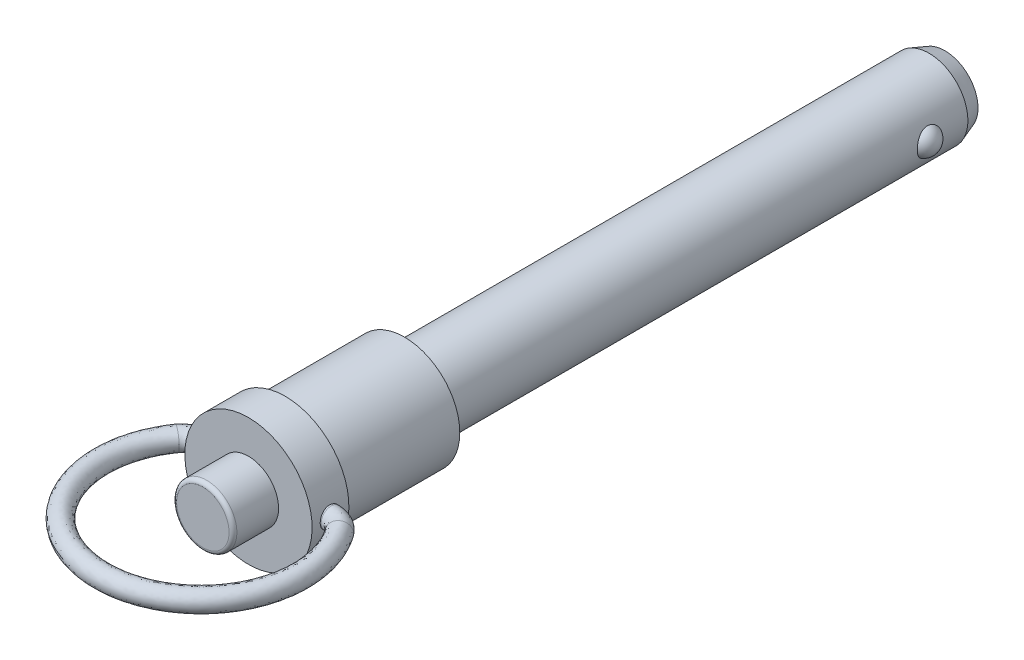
ISO-10303-21;
HEADER;
FILE_DESCRIPTION(('STEP AP214'),'2;1');
FILE_NAME('part.step','',(''),(''),'','','');
FILE_SCHEMA(('AUTOMOTIVE_DESIGN { 1 0 10303 214 1 1 1 1 }'));
ENDSEC;
DATA;
#1=APPLICATION_CONTEXT('core data for automotive mechanical design processes');
#2=APPLICATION_PROTOCOL_DEFINITION('international standard','automotive_design',2000,#1);
#3=PRODUCT_CONTEXT('',#1,'mechanical');
#4=PRODUCT('Part','Part','',(#3));
#5=PRODUCT_RELATED_PRODUCT_CATEGORY('part','',(#4));
#6=PRODUCT_DEFINITION_FORMATION('','',#4);
#7=PRODUCT_DEFINITION_CONTEXT('part definition',#1,'design');
#8=PRODUCT_DEFINITION('design','',#6,#7);
#9=PRODUCT_DEFINITION_SHAPE('','',#8);
#10=(LENGTH_UNIT() NAMED_UNIT(*) SI_UNIT(.MILLI.,.METRE.));
#11=(NAMED_UNIT(*) PLANE_ANGLE_UNIT() SI_UNIT($,.RADIAN.));
#12=(NAMED_UNIT(*) SI_UNIT($,.STERADIAN.) SOLID_ANGLE_UNIT());
#13=UNCERTAINTY_MEASURE_WITH_UNIT(LENGTH_MEASURE(1.E-05),#10,'distance_accuracy_value','');
#14=(GEOMETRIC_REPRESENTATION_CONTEXT(3) GLOBAL_UNCERTAINTY_ASSIGNED_CONTEXT((#13)) GLOBAL_UNIT_ASSIGNED_CONTEXT((#10,
#11,#12)) REPRESENTATION_CONTEXT('',''));
#15=CARTESIAN_POINT('',(0.,0.,0.));
#16=DIRECTION('',(0.,0.,1.));
#17=DIRECTION('',(1.,0.,0.));
#18=AXIS2_PLACEMENT_3D('',#15,#16,#17);
#19=CARTESIAN_POINT('',(0.,0.,25.765));
#20=DIRECTION('',(0.,0.,1.));
#21=DIRECTION('',(1.,0.,0.));
#22=AXIS2_PLACEMENT_3D('',#19,#20,#21);
#23=PLANE('',#22);
#24=CARTESIAN_POINT('',(0.,0.,25.765));
#25=DIRECTION('',(0.,0.,1.));
#26=DIRECTION('',(1.,0.,0.));
#27=AXIS2_PLACEMENT_3D('',#24,#25,#26);
#28=CIRCLE('',#27,3.3481);
#29=CARTESIAN_POINT('',(3.3481,0.,25.765));
#30=VERTEX_POINT('',#29);
#31=EDGE_CURVE('E141',#30,#30,#28,.T.);
#32=ORIENTED_EDGE('',*,*,#31,.T.);
#33=EDGE_LOOP('',(#32));
#34=FACE_BOUND('',#33,.T.);
#35=ADVANCED_FACE('F13',(#34),#23,.T.);
#36=CARTESIAN_POINT('',(0.,0.,25.265));
#37=DIRECTION('',(0.,0.,1.));
#38=DIRECTION('',(1.,0.,0.));
#39=AXIS2_PLACEMENT_3D('',#36,#37,#38);
#40=TOROIDAL_SURFACE('',#39,3.3481,0.5);
#41=CARTESIAN_POINT('',(0.,0.,25.265));
#42=DIRECTION('',(0.,0.,1.));
#43=DIRECTION('',(1.,0.,0.));
#44=AXIS2_PLACEMENT_3D('',#41,#42,#43);
#45=CIRCLE('',#44,3.8481);
#46=CARTESIAN_POINT('',(3.8481,0.,25.265));
#47=VERTEX_POINT('',#46);
#48=EDGE_CURVE('E138',#47,#47,#45,.T.);
#49=ORIENTED_EDGE('',*,*,#48,.T.);
#50=EDGE_LOOP('',(#49));
#51=FACE_BOUND('',#50,.T.);
#52=ORIENTED_EDGE('',*,*,#31,.F.);
#53=EDGE_LOOP('',(#52));
#54=FACE_BOUND('',#53,.T.);
#55=ADVANCED_FACE('F76',(#51,#54),#40,.T.);
#56=CARTESIAN_POINT('',(11.4497733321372,0.,17.9437724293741));
#57=CARTESIAN_POINT('',(11.8265676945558,0.,18.4801460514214));
#58=CARTESIAN_POINT('',(12.6551080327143,0.,19.8662433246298));
#59=CARTESIAN_POINT('',(13.4882796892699,0.,22.0133244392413));
#60=CARTESIAN_POINT('',(14.0014195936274,0.,24.4938075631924));
#61=CARTESIAN_POINT('',(14.0399868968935,0.,27.1482100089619));
#62=CARTESIAN_POINT('',(13.5501253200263,0.,29.8733661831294));
#63=CARTESIAN_POINT('',(12.5103672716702,0.,32.4943169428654));
#64=CARTESIAN_POINT('',(10.9649059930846,0.,34.8529407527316));
#65=CARTESIAN_POINT('',(9.01915526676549,0.,36.8217510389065));
#66=CARTESIAN_POINT('',(6.82219687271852,0.,38.3176313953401));
#67=CARTESIAN_POINT('',(4.51156788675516,0.,39.3254677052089));
#68=CARTESIAN_POINT('',(2.23137128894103,0.,39.879227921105));
#69=CARTESIAN_POINT('',(7.28333001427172E-13,0.,40.0580345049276));
#70=CARTESIAN_POINT('',(-2.23137128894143,0.,39.879227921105));
#71=CARTESIAN_POINT('',(-4.51156788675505,0.,39.3254677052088));
#72=CARTESIAN_POINT('',(-6.82219687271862,0.,38.31763139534));
#73=CARTESIAN_POINT('',(-9.01915526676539,0.,36.8217510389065));
#74=CARTESIAN_POINT('',(-10.9649059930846,0.,34.8529407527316));
#75=CARTESIAN_POINT('',(-12.5103672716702,0.,32.4943169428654));
#76=CARTESIAN_POINT('',(-13.5501253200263,0.,29.8733661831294));
#77=CARTESIAN_POINT('',(-14.0399868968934,0.,27.148210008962));
#78=CARTESIAN_POINT('',(-14.0014195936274,0.,24.4938075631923));
#79=CARTESIAN_POINT('',(-13.4882796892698,0.,22.0133244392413));
#80=CARTESIAN_POINT('',(-12.6551080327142,0.,19.8662433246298));
#81=CARTESIAN_POINT('',(-11.8265676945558,0.,18.4801460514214));
#82=CARTESIAN_POINT('',(-11.4497733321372,0.,17.9437724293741));
#83=CARTESIAN_POINT('',(11.4497733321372,-2.59999999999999,17.9437724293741));
#84=CARTESIAN_POINT('',(11.7096770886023,-2.59999999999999,18.3137501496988));
#85=CARTESIAN_POINT('',(12.7137877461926,-2.59999999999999,19.9497749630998));
#86=CARTESIAN_POINT('',(13.4708176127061,-2.59999999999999,21.9884668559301));
#87=CARTESIAN_POINT('',(14.0065482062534,-2.6,24.5011082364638));
#88=CARTESIAN_POINT('',(14.0385176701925,-2.59999999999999,27.1461185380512));
#89=CARTESIAN_POINT('',(13.5505344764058,-2.59999999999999,29.8739486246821));
#90=CARTESIAN_POINT('',(12.5102566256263,-2.59999999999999,32.4941594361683));
#91=CARTESIAN_POINT('',(10.9649350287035,-2.59999999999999,34.8529820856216));
#92=CARTESIAN_POINT('',(9.01914786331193,-2.6,36.8217404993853));
#93=CARTESIAN_POINT('',(6.82219870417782,-2.59999999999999,38.3176340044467));
#94=CARTESIAN_POINT('',(4.51156744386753,-2.59999999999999,39.3254670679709));
#95=CARTESIAN_POINT('',(2.23137138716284,-2.59999999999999,39.879228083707));
#96=CARTESIAN_POINT('',(7.28268272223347E-13,-2.59999999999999,40.0580344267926));
#97=CARTESIAN_POINT('',(-2.23137138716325,-2.6,39.879228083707));
#98=CARTESIAN_POINT('',(-4.51156744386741,-2.59999999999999,39.3254670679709));
#99=CARTESIAN_POINT('',(-6.82219870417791,-2.6,38.3176340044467));
#100=CARTESIAN_POINT('',(-9.01914786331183,-2.59999999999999,36.8217404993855));
#101=CARTESIAN_POINT('',(-10.9649350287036,-2.59999999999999,34.8529820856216));
#102=CARTESIAN_POINT('',(-12.5102566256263,-2.59999999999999,32.4941594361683));
#103=CARTESIAN_POINT('',(-13.5505344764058,-2.59999999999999,29.8739486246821));
#104=CARTESIAN_POINT('',(-14.0385176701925,-2.6,27.1461185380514));
#105=CARTESIAN_POINT('',(-14.0065482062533,-2.59999999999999,24.5011082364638));
#106=CARTESIAN_POINT('',(-13.4708176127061,-2.59999999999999,21.9884668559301));
#107=CARTESIAN_POINT('',(-12.7137877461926,-2.59999999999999,19.9497749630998));
#108=CARTESIAN_POINT('',(-11.7096770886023,-2.59999999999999,18.3137501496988));
#109=CARTESIAN_POINT('',(-11.4497733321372,-2.59999999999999,17.9437724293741));
#110=CARTESIAN_POINT('',(9.33442519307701,-2.59999999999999,19.4556422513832));
#111=CARTESIAN_POINT('',(9.59432894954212,-2.59999999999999,19.8256199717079));
#112=CARTESIAN_POINT('',(10.3328710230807,-2.59999999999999,21.0505437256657));
#113=CARTESIAN_POINT('',(10.9823054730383,-2.59999999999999,22.7644201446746));
#114=CARTESIAN_POINT('',(11.4042672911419,-2.6,24.7888114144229));
#115=CARTESIAN_POINT('',(11.4306312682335,-2.59999999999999,26.9493701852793));
#116=CARTESIAN_POINT('',(11.0308912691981,-2.59999999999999,29.1626260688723));
#117=CARTESIAN_POINT('',(10.1828123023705,-2.59999999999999,31.2968985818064));
#118=CARTESIAN_POINT('',(8.92160036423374,-2.59999999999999,33.2166725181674));
#119=CARTESIAN_POINT('',(7.34098330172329,-2.6,34.8144779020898));
#120=CARTESIAN_POINT('',(5.5491258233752,-2.59999999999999,36.0332448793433));
#121=CARTESIAN_POINT('',(3.67550207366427,-2.59999999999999,36.8497543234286));
#122=CARTESIAN_POINT('',(1.8109997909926,-2.59999999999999,37.3021941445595));
#123=CARTESIAN_POINT('',(-9.61358135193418E-13,-2.59999999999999,37.4469985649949));
#124=CARTESIAN_POINT('',(-1.81099979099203,-2.6,37.3021941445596));
#125=CARTESIAN_POINT('',(-3.6755020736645,-2.59999999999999,36.8497543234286));
#126=CARTESIAN_POINT('',(-5.54912582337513,-2.6,36.0332448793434));
#127=CARTESIAN_POINT('',(-7.34098330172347,-2.59999999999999,34.8144779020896));
#128=CARTESIAN_POINT('',(-8.92160036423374,-2.59999999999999,33.2166725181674));
#129=CARTESIAN_POINT('',(-10.1828123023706,-2.59999999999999,31.2968985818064));
#130=CARTESIAN_POINT('',(-11.0308912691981,-2.59999999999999,29.1626260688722));
#131=CARTESIAN_POINT('',(-11.4306312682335,-2.6,26.9493701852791));
#132=CARTESIAN_POINT('',(-11.4042672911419,-2.59999999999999,24.7888114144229));
#133=CARTESIAN_POINT('',(-10.9823054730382,-2.59999999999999,22.7644201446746));
#134=CARTESIAN_POINT('',(-10.3328710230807,-2.59999999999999,21.0505437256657));
#135=CARTESIAN_POINT('',(-9.59432894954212,-2.59999999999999,19.8256199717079));
#136=CARTESIAN_POINT('',(-9.33442519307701,-2.59999999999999,19.4556422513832));
#137=CARTESIAN_POINT('',(9.33442519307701,0.,19.4556422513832));
#138=CARTESIAN_POINT('',(9.65277425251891,0.,19.9088179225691));
#139=CARTESIAN_POINT('',(10.3035311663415,0.,21.0087779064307));
#140=CARTESIAN_POINT('',(10.9910365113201,0.,22.7768489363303));
#141=CARTESIAN_POINT('',(11.4017029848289,0.,24.7851610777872));
#142=CARTESIAN_POINT('',(11.431365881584,0.,26.9504159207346));
#143=CARTESIAN_POINT('',(11.0306866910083,0.,29.1623348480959));
#144=CARTESIAN_POINT('',(10.1828676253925,0.,31.2969773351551));
#145=CARTESIAN_POINT('',(8.92158584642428,0.,33.2166518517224));
#146=CARTESIAN_POINT('',(7.34098700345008,0.,34.8144831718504));
#147=CARTESIAN_POINT('',(5.54912490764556,0.,36.03324357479));
#148=CARTESIAN_POINT('',(3.67550229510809,0.,36.8497546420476));
#149=CARTESIAN_POINT('',(1.8109997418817,0.,37.3021940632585));
#150=CARTESIAN_POINT('',(-9.6127182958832E-13,0.,37.4469986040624));
#151=CARTESIAN_POINT('',(-1.81099974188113,0.,37.3021940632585));
#152=CARTESIAN_POINT('',(-3.67550229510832,0.,36.8497546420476));
#153=CARTESIAN_POINT('',(-5.54912490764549,0.,36.03324357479));
#154=CARTESIAN_POINT('',(-7.34098700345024,0.,34.8144831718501));
#155=CARTESIAN_POINT('',(-8.92158584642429,0.,33.2166518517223));
#156=CARTESIAN_POINT('',(-10.1828676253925,0.,31.296977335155));
#157=CARTESIAN_POINT('',(-11.0306866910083,0.,29.1623348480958));
#158=CARTESIAN_POINT('',(-11.431365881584,0.,26.9504159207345));
#159=CARTESIAN_POINT('',(-11.4017029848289,0.,24.7851610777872));
#160=CARTESIAN_POINT('',(-10.9910365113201,0.,22.7768489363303));
#161=CARTESIAN_POINT('',(-10.3035311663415,0.,21.0087779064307));
#162=CARTESIAN_POINT('',(-9.6527742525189,0.,19.9088179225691));
#163=CARTESIAN_POINT('',(-9.33442519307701,0.,19.4556422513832));
#164=CARTESIAN_POINT('',(9.33442519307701,2.59999999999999,19.4556422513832));
#165=CARTESIAN_POINT('',(9.7112195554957,2.59999999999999,19.9920158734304));
#166=CARTESIAN_POINT('',(10.2741913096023,2.59999999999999,20.9670120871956));
#167=CARTESIAN_POINT('',(10.999767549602,2.59999999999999,22.7892777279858));
#168=CARTESIAN_POINT('',(11.3991386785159,2.6,24.7815107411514));
#169=CARTESIAN_POINT('',(11.4321004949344,2.59999999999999,26.9514616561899));
#170=CARTESIAN_POINT('',(11.0304821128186,2.59999999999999,29.1620436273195));
#171=CARTESIAN_POINT('',(10.1829229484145,2.59999999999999,31.2970560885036));
#172=CARTESIAN_POINT('',(8.92157132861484,2.59999999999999,33.2166311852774));
#173=CARTESIAN_POINT('',(7.34099070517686,2.6,34.8144884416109));
#174=CARTESIAN_POINT('',(5.54912399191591,2.59999999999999,36.0332422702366));
#175=CARTESIAN_POINT('',(3.67550251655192,2.59999999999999,36.8497549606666));
#176=CARTESIAN_POINT('',(1.81099969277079,2.59999999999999,37.3021939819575));
#177=CARTESIAN_POINT('',(-9.61422864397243E-13,2.59999999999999,37.4469986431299));
#178=CARTESIAN_POINT('',(-1.81099969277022,2.6,37.3021939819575));
#179=CARTESIAN_POINT('',(-3.67550251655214,2.59999999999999,36.8497549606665));
#180=CARTESIAN_POINT('',(-5.54912399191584,2.6,36.0332422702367));
#181=CARTESIAN_POINT('',(-7.34099070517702,2.59999999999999,34.8144884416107));
#182=CARTESIAN_POINT('',(-8.92157132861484,2.59999999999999,33.2166311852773));
#183=CARTESIAN_POINT('',(-10.1829229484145,2.59999999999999,31.2970560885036));
#184=CARTESIAN_POINT('',(-11.0304821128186,2.59999999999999,29.1620436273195));
#185=CARTESIAN_POINT('',(-11.4321004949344,2.6,26.9514616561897));
#186=CARTESIAN_POINT('',(-11.3991386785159,2.59999999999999,24.7815107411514));
#187=CARTESIAN_POINT('',(-10.999767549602,2.59999999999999,22.7892777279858));
#188=CARTESIAN_POINT('',(-10.2741913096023,2.59999999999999,20.9670120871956));
#189=CARTESIAN_POINT('',(-9.71121955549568,2.59999999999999,19.9920158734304));
#190=CARTESIAN_POINT('',(-9.33442519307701,2.59999999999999,19.4556422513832));
#191=CARTESIAN_POINT('',(11.4497733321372,2.59999999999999,17.9437724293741));
#192=CARTESIAN_POINT('',(11.9434583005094,2.59999999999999,18.6465419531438));
#193=CARTESIAN_POINT('',(12.5964283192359,2.59999999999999,19.7827116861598));
#194=CARTESIAN_POINT('',(13.5057417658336,2.59999999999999,22.0381820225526));
#195=CARTESIAN_POINT('',(13.9962909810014,2.6,24.4865068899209));
#196=CARTESIAN_POINT('',(14.0414561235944,2.59999999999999,27.1503014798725));
#197=CARTESIAN_POINT('',(13.5497161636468,2.59999999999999,29.8727837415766));
#198=CARTESIAN_POINT('',(12.5104779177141,2.59999999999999,32.4944744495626));
#199=CARTESIAN_POINT('',(10.9648769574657,2.59999999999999,34.8528994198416));
#200=CARTESIAN_POINT('',(9.01916267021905,2.6,36.8217615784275));
#201=CARTESIAN_POINT('',(6.82219504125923,2.59999999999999,38.3176287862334));
#202=CARTESIAN_POINT('',(4.5115683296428,2.59999999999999,39.3254683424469));
#203=CARTESIAN_POINT('',(2.23137119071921,2.59999999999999,39.8792277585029));
#204=CARTESIAN_POINT('',(7.28203543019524E-13,2.59999999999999,40.0580345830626));
#205=CARTESIAN_POINT('',(-2.23137119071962,2.6,39.879227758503));
#206=CARTESIAN_POINT('',(-4.51156832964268,2.59999999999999,39.3254683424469));
#207=CARTESIAN_POINT('',(-6.82219504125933,2.6,38.3176287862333));
#208=CARTESIAN_POINT('',(-9.01916267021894,2.59999999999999,36.8217615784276));
#209=CARTESIAN_POINT('',(-10.9648769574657,2.59999999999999,34.8528994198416));
#210=CARTESIAN_POINT('',(-12.5104779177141,2.59999999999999,32.4944744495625));
#211=CARTESIAN_POINT('',(-13.5497161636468,2.59999999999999,29.8727837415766));
#212=CARTESIAN_POINT('',(-14.0414561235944,2.6,27.1503014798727));
#213=CARTESIAN_POINT('',(-13.9962909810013,2.59999999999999,24.4865068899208));
#214=CARTESIAN_POINT('',(-13.5057417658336,2.59999999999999,22.0381820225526));
#215=CARTESIAN_POINT('',(-12.5964283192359,2.59999999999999,19.7827116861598));
#216=CARTESIAN_POINT('',(-11.9434583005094,2.59999999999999,18.6465419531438));
#217=CARTESIAN_POINT('',(-11.4497733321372,2.59999999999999,17.9437724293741));
#218=CARTESIAN_POINT('',(11.4497733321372,0.,17.9437724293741));
#219=CARTESIAN_POINT('',(11.8265676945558,0.,18.4801460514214));
#220=CARTESIAN_POINT('',(12.6551080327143,0.,19.8662433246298));
#221=CARTESIAN_POINT('',(13.4882796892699,0.,22.0133244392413));
#222=CARTESIAN_POINT('',(14.0014195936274,0.,24.4938075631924));
#223=CARTESIAN_POINT('',(14.0399868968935,0.,27.1482100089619));
#224=CARTESIAN_POINT('',(13.5501253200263,0.,29.8733661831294));
#225=CARTESIAN_POINT('',(12.5103672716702,0.,32.4943169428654));
#226=CARTESIAN_POINT('',(10.9649059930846,0.,34.8529407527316));
#227=CARTESIAN_POINT('',(9.01915526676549,0.,36.8217510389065));
#228=CARTESIAN_POINT('',(6.82219687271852,0.,38.3176313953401));
#229=CARTESIAN_POINT('',(4.51156788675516,0.,39.3254677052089));
#230=CARTESIAN_POINT('',(2.23137128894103,0.,39.879227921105));
#231=CARTESIAN_POINT('',(7.28333001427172E-13,0.,40.0580345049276));
#232=CARTESIAN_POINT('',(-2.23137128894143,0.,39.879227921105));
#233=CARTESIAN_POINT('',(-4.51156788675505,0.,39.3254677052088));
#234=CARTESIAN_POINT('',(-6.82219687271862,0.,38.31763139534));
#235=CARTESIAN_POINT('',(-9.01915526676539,0.,36.8217510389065));
#236=CARTESIAN_POINT('',(-10.9649059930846,0.,34.8529407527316));
#237=CARTESIAN_POINT('',(-12.5103672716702,0.,32.4943169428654));
#238=CARTESIAN_POINT('',(-13.5501253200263,0.,29.8733661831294));
#239=CARTESIAN_POINT('',(-14.0399868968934,0.,27.148210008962));
#240=CARTESIAN_POINT('',(-14.0014195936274,0.,24.4938075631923));
#241=CARTESIAN_POINT('',(-13.4882796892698,0.,22.0133244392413));
#242=CARTESIAN_POINT('',(-12.6551080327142,0.,19.8662433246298));
#243=CARTESIAN_POINT('',(-11.8265676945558,0.,18.4801460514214));
#244=CARTESIAN_POINT('',(-11.4497733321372,0.,17.9437724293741));
#245=(BOUNDED_SURFACE() B_SPLINE_SURFACE(3,3,((#56,#57,#58,#59,#60,#61,#62,#63,#64,#65,#66,#67,
#68,#69,#70,#71,#72,#73,#74,#75,#76,#77,#78,#79,#80,#81,#82),(#83,#84,#85,#86,#87,#88,#89,#90,
#91,#92,#93,#94,#95,#96,#97,#98,#99,#100,#101,#102,#103,#104,#105,#106,#107,#108,#109),(#110,
#111,#112,#113,#114,#115,#116,#117,#118,#119,#120,#121,#122,#123,#124,#125,#126,#127,#128,#129,
#130,#131,#132,#133,#134,#135,#136),(#137,#138,#139,#140,#141,#142,#143,#144,#145,#146,#147,
#148,#149,#150,#151,#152,#153,#154,#155,#156,#157,#158,#159,#160,#161,#162,#163),(#164,#165,
#166,#167,#168,#169,#170,#171,#172,#173,#174,#175,#176,#177,#178,#179,#180,#181,#182,#183,#184,
#185,#186,#187,#188,#189,#190),(#191,#192,#193,#194,#195,#196,#197,#198,#199,#200,#201,#202,
#203,#204,#205,#206,#207,#208,#209,#210,#211,#212,#213,#214,#215,#216,#217),(#218,#219,#220,
#221,#222,#223,#224,#225,#226,#227,#228,#229,#230,#231,#232,#233,#234,#235,#236,#237,#238,#239,
#240,#241,#242,#243,#244)),.UNSPECIFIED.,.T.,.F.,.F.) B_SPLINE_SURFACE_WITH_KNOTS((4,3,4),(4,1,
1,1,1,1,1,1,1,1,1,1,1,1,1,1,1,1,1,1,1,1,1,1,4),(0.,0.5,1.),(0.,0.0355177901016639,
0.0739139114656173,0.114982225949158,0.158533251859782,0.203808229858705,0.250000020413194,
0.296191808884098,0.34146678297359,0.385017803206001,0.426086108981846,0.464482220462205,0.5,
0.535517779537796,0.573913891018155,0.614982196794,0.658533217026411,0.703808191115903,
0.749999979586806,0.796191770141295,0.841466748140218,0.885017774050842,0.926086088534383,
0.964482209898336,1.),
.UNSPECIFIED.) GEOMETRIC_REPRESENTATION_ITEM() RATIONAL_B_SPLINE_SURFACE(((1.,1.,1.,1.,1.,1.,1.,
1.,1.,1.,1.,1.,1.,1.,1.,1.,1.,1.,1.,1.,1.,1.,1.,1.,1.,1.,1.),(0.333333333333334,
0.333333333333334,0.333333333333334,0.333333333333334,0.333333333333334,0.333333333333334,
0.333333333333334,0.333333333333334,0.333333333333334,0.333333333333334,0.333333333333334,
0.333333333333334,0.333333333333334,0.333333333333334,0.333333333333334,0.333333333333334,
0.333333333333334,0.333333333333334,0.333333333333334,0.333333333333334,0.333333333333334,
0.333333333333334,0.333333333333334,0.333333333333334,0.333333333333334,0.333333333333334,
0.333333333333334),(0.333333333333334,0.333333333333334,0.333333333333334,0.333333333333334,
0.333333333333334,0.333333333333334,0.333333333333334,0.333333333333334,0.333333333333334,
0.333333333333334,0.333333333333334,0.333333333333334,0.333333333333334,0.333333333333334,
0.333333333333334,0.333333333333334,0.333333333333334,0.333333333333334,0.333333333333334,
0.333333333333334,0.333333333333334,0.333333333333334,0.333333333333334,0.333333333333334,
0.333333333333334,0.333333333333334,0.333333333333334),(1.,1.,1.,1.,1.,1.,1.,1.,1.,1.,1.,1.,1.,
1.,1.,1.,1.,1.,1.,1.,1.,1.,1.,1.,1.,1.,1.),(0.333333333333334,0.333333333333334,
0.333333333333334,0.333333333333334,0.333333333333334,0.333333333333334,0.333333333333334,
0.333333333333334,0.333333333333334,0.333333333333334,0.333333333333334,0.333333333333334,
0.333333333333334,0.333333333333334,0.333333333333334,0.333333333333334,0.333333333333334,
0.333333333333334,0.333333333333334,0.333333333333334,0.333333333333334,0.333333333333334,
0.333333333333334,0.333333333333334,0.333333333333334,0.333333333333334,0.333333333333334),
(0.333333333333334,0.333333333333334,0.333333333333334,0.333333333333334,0.333333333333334,
0.333333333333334,0.333333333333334,0.333333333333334,0.333333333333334,0.333333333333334,
0.333333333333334,0.333333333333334,0.333333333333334,0.333333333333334,0.333333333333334,
0.333333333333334,0.333333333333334,0.333333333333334,0.333333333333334,0.333333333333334,
0.333333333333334,0.333333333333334,0.333333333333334,0.333333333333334,0.333333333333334,
0.333333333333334,0.333333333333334),(1.,1.,1.,1.,1.,1.,1.,1.,1.,1.,1.,1.,1.,1.,1.,1.,1.,1.,1.,
1.,1.,1.,1.,1.,1.,1.,1.))) REPRESENTATION_ITEM('') SURFACE());
#246=CARTESIAN_POINT('',(11.4497733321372,0.,17.9437724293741));
#247=CARTESIAN_POINT('',(11.4497733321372,-2.59999999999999,17.9437724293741));
#248=CARTESIAN_POINT('',(9.33442519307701,-2.59999999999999,19.4556422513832));
#249=CARTESIAN_POINT('',(9.33442519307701,0.,19.4556422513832));
#250=CARTESIAN_POINT('',(9.33442519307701,2.59999999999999,19.4556422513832));
#251=CARTESIAN_POINT('',(11.4497733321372,2.59999999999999,17.9437724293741));
#252=CARTESIAN_POINT('',(11.4497733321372,0.,17.9437724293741));
#253=(BOUNDED_CURVE() B_SPLINE_CURVE(3,(#246,#247,#248,#249,#250,#251,#252),.UNSPECIFIED.,.T.,
.F.) B_SPLINE_CURVE_WITH_KNOTS((4,3,4),(0.,0.5,1.),
.UNSPECIFIED.) CURVE() GEOMETRIC_REPRESENTATION_ITEM() RATIONAL_B_SPLINE_CURVE((1.,
0.333333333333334,0.333333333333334,1.,0.333333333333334,0.333333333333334,1.)) REPRESENTATION_ITEM(''));
#254=CARTESIAN_POINT('',(11.4497733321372,0.,17.9437724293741));
#255=VERTEX_POINT('',#254);
#256=EDGE_CURVE('E176',#255,#255,#253,.T.);
#257=CARTESIAN_POINT('',(-11.4497733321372,0.,17.9437724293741));
#258=CARTESIAN_POINT('',(-11.4497733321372,-2.59999999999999,17.9437724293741));
#259=CARTESIAN_POINT('',(-9.33442519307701,-2.59999999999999,19.4556422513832));
#260=CARTESIAN_POINT('',(-9.33442519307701,0.,19.4556422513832));
#261=CARTESIAN_POINT('',(-9.33442519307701,2.59999999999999,19.4556422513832));
#262=CARTESIAN_POINT('',(-11.4497733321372,2.59999999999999,17.9437724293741));
#263=CARTESIAN_POINT('',(-11.4497733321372,0.,17.9437724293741));
#264=(BOUNDED_CURVE() B_SPLINE_CURVE(3,(#257,#258,#259,#260,#261,#262,#263),.UNSPECIFIED.,.T.,
.F.) B_SPLINE_CURVE_WITH_KNOTS((4,3,4),(0.,0.5,1.),
.UNSPECIFIED.) CURVE() GEOMETRIC_REPRESENTATION_ITEM() RATIONAL_B_SPLINE_CURVE((1.,
0.333333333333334,0.333333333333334,1.,0.333333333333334,0.333333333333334,1.)) REPRESENTATION_ITEM(''));
#265=CARTESIAN_POINT('',(-11.4497733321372,0.,17.9437724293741));
#266=VERTEX_POINT('',#265);
#267=EDGE_CURVE('E174',#266,#266,#264,.F.);
#268=ORIENTED_EDGE('',*,*,#256,.F.);
#269=EDGE_LOOP('',(#268));
#270=FACE_BOUND('',#269,.T.);
#271=ORIENTED_EDGE('',*,*,#267,.F.);
#272=EDGE_LOOP('',(#271));
#273=FACE_BOUND('',#272,.T.);
#274=ADVANCED_FACE('F82',(#270,#273),#245,.F.);
#275=CARTESIAN_POINT('',(8.23717073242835,0.,16.3022));
#276=CARTESIAN_POINT('',(8.39026579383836,0.,16.3022));
#277=CARTESIAN_POINT('',(8.96971374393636,0.,16.3453113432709));
#278=CARTESIAN_POINT('',(9.59211406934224,0.,16.5211040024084));
#279=CARTESIAN_POINT('',(10.3031381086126,0.,16.8555507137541));
#280=CARTESIAN_POINT('',(10.8955792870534,0.,17.2786190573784));
#281=CARTESIAN_POINT('',(11.3434296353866,0.,17.7975125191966));
#282=CARTESIAN_POINT('',(11.4497733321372,0.,17.9437724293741));
#283=CARTESIAN_POINT('',(8.23717073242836,2.59999999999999,16.3022));
#284=CARTESIAN_POINT('',(8.16213736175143,2.59999999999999,16.3022));
#285=CARTESIAN_POINT('',(9.0792865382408,2.59999999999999,16.3469383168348));
#286=CARTESIAN_POINT('',(9.55822083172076,2.6,16.5152316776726));
#287=CARTESIAN_POINT('',(10.3298909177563,2.59999999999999,16.879237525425));
#288=CARTESIAN_POINT('',(10.8172738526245,2.59999999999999,17.1748054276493));
#289=CARTESIAN_POINT('',(11.5008843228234,2.59999999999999,18.0140679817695));
#290=CARTESIAN_POINT('',(11.4497733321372,2.59999999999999,17.9437724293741));
#291=CARTESIAN_POINT('',(8.23717073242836,2.59999999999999,18.9022));
#292=CARTESIAN_POINT('',(8.16213736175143,2.59999999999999,18.9022));
#293=CARTESIAN_POINT('',(8.54034086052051,2.59999999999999,18.9167455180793));
#294=CARTESIAN_POINT('',(8.68812752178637,2.6,18.9762506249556));
#295=CARTESIAN_POINT('',(8.94759350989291,2.59999999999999,19.0969960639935));
#296=CARTESIAN_POINT('',(9.10292826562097,2.59999999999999,19.1770581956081));
#297=CARTESIAN_POINT('',(9.38553618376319,2.59999999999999,19.5259378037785));
#298=CARTESIAN_POINT('',(9.33442519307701,2.59999999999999,19.4556422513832));
#299=CARTESIAN_POINT('',(8.23717073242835,0.,18.9022));
#300=CARTESIAN_POINT('',(8.2762015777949,0.,18.9022));
#301=CARTESIAN_POINT('',(8.48555446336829,0.,18.9159320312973));
#302=CARTESIAN_POINT('',(8.70507414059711,0.,18.9791867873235));
#303=CARTESIAN_POINT('',(8.93421710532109,0.,19.0851526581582));
#304=CARTESIAN_POINT('',(9.14208098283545,0.,19.2289650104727));
#305=CARTESIAN_POINT('',(9.30680884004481,0.,19.4176600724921));
#306=CARTESIAN_POINT('',(9.33442519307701,0.,19.4556422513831));
#307=CARTESIAN_POINT('',(8.23717073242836,-2.59999999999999,18.9022));
#308=CARTESIAN_POINT('',(8.39026579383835,-2.59999999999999,18.9022));
#309=CARTESIAN_POINT('',(8.43076806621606,-2.59999999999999,18.9151185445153));
#310=CARTESIAN_POINT('',(8.72202075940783,-2.6,18.9821229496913));
#311=CARTESIAN_POINT('',(8.92084070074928,-2.59999999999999,19.0733092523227));
#312=CARTESIAN_POINT('',(9.1812337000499,-2.59999999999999,19.2808718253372));
#313=CARTESIAN_POINT('',(9.22808149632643,-2.59999999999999,19.3093823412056));
#314=CARTESIAN_POINT('',(9.33442519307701,-2.59999999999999,19.4556422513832));
#315=CARTESIAN_POINT('',(8.23717073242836,-2.59999999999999,16.3022));
#316=CARTESIAN_POINT('',(8.61839422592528,-2.59999999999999,16.3022));
#317=CARTESIAN_POINT('',(8.8601409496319,-2.59999999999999,16.3436843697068));
#318=CARTESIAN_POINT('',(9.6260073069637,-2.6,16.5269763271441));
#319=CARTESIAN_POINT('',(10.276385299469,-2.59999999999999,16.8318639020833));
#320=CARTESIAN_POINT('',(10.9738847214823,-2.59999999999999,17.3824326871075));
#321=CARTESIAN_POINT('',(11.1859749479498,-2.59999999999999,17.5809570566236));
#322=CARTESIAN_POINT('',(11.4497733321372,-2.59999999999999,17.9437724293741));
#323=CARTESIAN_POINT('',(8.23717073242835,0.,16.3022));
#324=CARTESIAN_POINT('',(8.39026579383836,0.,16.3022));
#325=CARTESIAN_POINT('',(8.96971374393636,0.,16.3453113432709));
#326=CARTESIAN_POINT('',(9.59211406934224,0.,16.5211040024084));
#327=CARTESIAN_POINT('',(10.3031381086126,0.,16.8555507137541));
#328=CARTESIAN_POINT('',(10.8955792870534,0.,17.2786190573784));
#329=CARTESIAN_POINT('',(11.3434296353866,0.,17.7975125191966));
#330=CARTESIAN_POINT('',(11.4497733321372,0.,17.9437724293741));
#331=(BOUNDED_SURFACE() B_SPLINE_SURFACE(3,3,((#275,#276,#277,#278,#279,#280,#281,#282),(#283,
#284,#285,#286,#287,#288,#289,#290),(#291,#292,#293,#294,#295,#296,#297,#298),(#299,#300,#301,
#302,#303,#304,#305,#306),(#307,#308,#309,#310,#311,#312,#313,#314),(#315,#316,#317,#318,#319,
#320,#321,#322),(#323,#324,#325,#326,#327,#328,#329,#330)),.UNSPECIFIED.,.T.,.F.,
.F.) B_SPLINE_SURFACE_WITH_KNOTS((4,3,4),(4,1,1,1,1,4),(0.,0.5,1.),(0.,0.183393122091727,
0.371127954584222,0.561360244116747,0.78346967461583,1.),
.UNSPECIFIED.) GEOMETRIC_REPRESENTATION_ITEM() RATIONAL_B_SPLINE_SURFACE(((1.,1.,1.,1.,1.,1.,1.,
1.),(0.333333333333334,0.333333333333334,0.333333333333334,0.333333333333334,0.333333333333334,
0.333333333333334,0.333333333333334,0.333333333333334),(0.333333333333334,0.333333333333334,
0.333333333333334,0.333333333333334,0.333333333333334,0.333333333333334,0.333333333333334,
0.333333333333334),(1.,1.,1.,1.,1.,1.,1.,1.),(0.333333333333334,0.333333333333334,
0.333333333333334,0.333333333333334,0.333333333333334,0.333333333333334,0.333333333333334,
0.333333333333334),(0.333333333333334,0.333333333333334,0.333333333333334,0.333333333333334,
0.333333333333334,0.333333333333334,0.333333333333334,0.333333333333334),(1.,1.,1.,1.,1.,1.,1.,1.))) REPRESENTATION_ITEM('') SURFACE());
#332=CARTESIAN_POINT('',(8.23717073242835,0.,17.6022));
#333=DIRECTION('',(1.,0.,0.));
#334=DIRECTION('',(0.,0.,-1.));
#335=AXIS2_PLACEMENT_3D('',#332,#333,#334);
#336=CIRCLE('',#335,1.3);
#337=CARTESIAN_POINT('',(8.23717073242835,0.,16.3022));
#338=VERTEX_POINT('',#337);
#339=EDGE_CURVE('E112',#338,#338,#336,.T.);
#340=ORIENTED_EDGE('',*,*,#339,.T.);
#341=EDGE_LOOP('',(#340));
#342=FACE_BOUND('',#341,.T.);
#343=ORIENTED_EDGE('',*,*,#256,.T.);
#344=EDGE_LOOP('',(#343));
#345=FACE_BOUND('',#344,.T.);
#346=ADVANCED_FACE('F92',(#342,#345),#331,.T.);
#347=CARTESIAN_POINT('',(0.,0.,24.765));
#348=DIRECTION('',(0.,0.,-1.));
#349=DIRECTION('',(0.,1.,0.));
#350=AXIS2_PLACEMENT_3D('',#347,#348,#349);
#351=CYLINDRICAL_SURFACE('',#350,3.8481);
#352=CARTESIAN_POINT('',(0.,0.,19.939));
#353=DIRECTION('',(0.,0.,-1.));
#354=DIRECTION('',(0.,1.,0.));
#355=AXIS2_PLACEMENT_3D('',#352,#353,#354);
#356=CIRCLE('',#355,3.8481);
#357=CARTESIAN_POINT('',(0.,3.8481,19.939));
#358=VERTEX_POINT('',#357);
#359=EDGE_CURVE('E148',#358,#358,#356,.T.);
#360=ORIENTED_EDGE('',*,*,#359,.F.);
#361=EDGE_LOOP('',(#360));
#362=FACE_BOUND('',#361,.T.);
#363=ORIENTED_EDGE('',*,*,#48,.F.);
#364=EDGE_LOOP('',(#363));
#365=FACE_BOUND('',#364,.T.);
#366=ADVANCED_FACE('F88',(#362,#365),#351,.T.);
#367=CARTESIAN_POINT('',(-11.4497733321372,0.,17.9437724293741));
#368=CARTESIAN_POINT('',(-11.3597411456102,0.,17.8199465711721));
#369=CARTESIAN_POINT('',(-10.985804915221,0.,17.3752654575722));
#370=CARTESIAN_POINT('',(-10.4784291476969,0.,16.9741029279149));
#371=CARTESIAN_POINT('',(-9.7908926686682,0.,16.5936956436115));
#372=CARTESIAN_POINT('',(-9.10089921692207,0.,16.3618307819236));
#373=CARTESIAN_POINT('',(-8.41800257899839,0.,16.3022));
#374=CARTESIAN_POINT('',(-8.23717073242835,0.,16.3022));
#375=CARTESIAN_POINT('',(-11.4497733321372,2.59999999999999,17.9437724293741));
#376=CARTESIAN_POINT('',(-11.4938947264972,2.59999999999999,18.0044548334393));
#377=CARTESIAN_POINT('',(-10.9200537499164,2.59999999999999,17.2876012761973));
#378=CARTESIAN_POINT('',(-10.503110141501,2.6,16.9980618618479));
#379=CARTESIAN_POINT('',(-9.75600116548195,2.59999999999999,16.585987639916));
#380=CARTESIAN_POINT('',(-9.23091765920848,2.59999999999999,16.3641146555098));
#381=CARTESIAN_POINT('',(-8.15024985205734,2.59999999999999,16.3022));
#382=CARTESIAN_POINT('',(-8.23717073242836,2.59999999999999,16.3022));
#383=CARTESIAN_POINT('',(-9.33442519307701,2.59999999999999,19.4556422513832));
#384=CARTESIAN_POINT('',(-9.37854658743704,2.59999999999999,19.5163246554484));
#385=CARTESIAN_POINT('',(-9.14268985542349,2.59999999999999,19.2203693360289));
#386=CARTESIAN_POINT('',(-9.00682479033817,2.6,19.1369648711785));
#387=CARTESIAN_POINT('',(-8.7554763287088,2.59999999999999,19.0001197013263));
#388=CARTESIAN_POINT('',(-8.59879927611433,2.59999999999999,18.9230559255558));
#389=CARTESIAN_POINT('',(-8.15024985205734,2.59999999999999,18.9022));
#390=CARTESIAN_POINT('',(-8.23717073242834,2.59999999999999,18.9022));
#391=CARTESIAN_POINT('',(-9.334425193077,0.,19.4556422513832));
#392=CARTESIAN_POINT('',(-9.31146979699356,0.,19.4240705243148));
#393=CARTESIAN_POINT('',(-9.17556543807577,0.,19.2642014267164));
#394=CARTESIAN_POINT('',(-8.99448429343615,0.,19.124985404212));
#395=CARTESIAN_POINT('',(-8.77292208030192,0.,19.0039737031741));
#396=CARTESIAN_POINT('',(-8.53379005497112,0.,18.9219139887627));
#397=CARTESIAN_POINT('',(-8.28412621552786,0.,18.9022));
#398=CARTESIAN_POINT('',(-8.23717073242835,0.,18.9022));
#399=CARTESIAN_POINT('',(-9.33442519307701,-2.59999999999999,19.4556422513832));
#400=CARTESIAN_POINT('',(-9.24439300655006,-2.59999999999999,19.3318163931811));
#401=CARTESIAN_POINT('',(-9.20844102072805,-2.59999999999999,19.3080335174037));
#402=CARTESIAN_POINT('',(-8.98214379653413,-2.6,19.1130059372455));
#403=CARTESIAN_POINT('',(-8.79036783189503,-2.59999999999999,19.0078277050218));
#404=CARTESIAN_POINT('',(-8.46878083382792,-2.59999999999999,18.9207720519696));
#405=CARTESIAN_POINT('',(-8.41800257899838,-2.59999999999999,18.9022));
#406=CARTESIAN_POINT('',(-8.23717073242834,-2.59999999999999,18.9022));
#407=CARTESIAN_POINT('',(-11.4497733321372,-2.59999999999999,17.9437724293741));
#408=CARTESIAN_POINT('',(-11.2255875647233,-2.59999999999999,17.6354383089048));
#409=CARTESIAN_POINT('',(-11.0515560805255,-2.59999999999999,17.4629296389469));
#410=CARTESIAN_POINT('',(-10.4537481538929,-2.6,16.9501439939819));
#411=CARTESIAN_POINT('',(-9.82578417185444,-2.59999999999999,16.6014036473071));
#412=CARTESIAN_POINT('',(-8.97088077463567,-2.59999999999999,16.3595469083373));
#413=CARTESIAN_POINT('',(-8.68575530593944,-2.59999999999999,16.3022));
#414=CARTESIAN_POINT('',(-8.23717073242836,-2.59999999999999,16.3022));
#415=CARTESIAN_POINT('',(-11.4497733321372,0.,17.9437724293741));
#416=CARTESIAN_POINT('',(-11.3597411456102,0.,17.8199465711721));
#417=CARTESIAN_POINT('',(-10.985804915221,0.,17.3752654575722));
#418=CARTESIAN_POINT('',(-10.4784291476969,0.,16.9741029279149));
#419=CARTESIAN_POINT('',(-9.7908926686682,0.,16.5936956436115));
#420=CARTESIAN_POINT('',(-9.10089921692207,0.,16.3618307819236));
#421=CARTESIAN_POINT('',(-8.41800257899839,0.,16.3022));
#422=CARTESIAN_POINT('',(-8.23717073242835,0.,16.3022));
#423=(BOUNDED_SURFACE() B_SPLINE_SURFACE(3,3,((#367,#368,#369,#370,#371,#372,#373,#374),(#375,
#376,#377,#378,#379,#380,#381,#382),(#383,#384,#385,#386,#387,#388,#389,#390),(#391,#392,#393,
#394,#395,#396,#397,#398),(#399,#400,#401,#402,#403,#404,#405,#406),(#407,#408,#409,#410,#411,
#412,#413,#414),(#415,#416,#417,#418,#419,#420,#421,#422)),.UNSPECIFIED.,.T.,.F.,
.F.) B_SPLINE_SURFACE_WITH_KNOTS((4,3,4),(4,1,1,1,1,4),(0.,0.5,1.),(0.,0.183394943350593,
0.371130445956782,0.561362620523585,0.783471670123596,1.),
.UNSPECIFIED.) GEOMETRIC_REPRESENTATION_ITEM() RATIONAL_B_SPLINE_SURFACE(((1.,1.,1.,1.,1.,1.,1.,
1.),(0.333333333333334,0.333333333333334,0.333333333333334,0.333333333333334,0.333333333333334,
0.333333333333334,0.333333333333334,0.333333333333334),(0.333333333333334,0.333333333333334,
0.333333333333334,0.333333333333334,0.333333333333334,0.333333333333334,0.333333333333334,
0.333333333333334),(1.,1.,1.,1.,1.,1.,1.,1.),(0.333333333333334,0.333333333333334,
0.333333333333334,0.333333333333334,0.333333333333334,0.333333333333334,0.333333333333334,
0.333333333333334),(0.333333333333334,0.333333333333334,0.333333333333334,0.333333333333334,
0.333333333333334,0.333333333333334,0.333333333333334,0.333333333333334),(1.,1.,1.,1.,1.,1.,1.,1.))) REPRESENTATION_ITEM('') SURFACE());
#424=CARTESIAN_POINT('',(-8.23717073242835,0.,17.6022));
#425=DIRECTION('',(-1.,0.,0.));
#426=DIRECTION('',(0.,0.,1.));
#427=AXIS2_PLACEMENT_3D('',#424,#425,#426);
#428=CIRCLE('',#427,1.3);
#429=CARTESIAN_POINT('',(-8.23717073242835,0.,18.9022));
#430=VERTEX_POINT('',#429);
#431=EDGE_CURVE('E180',#430,#430,#428,.T.);
#432=ORIENTED_EDGE('',*,*,#267,.T.);
#433=EDGE_LOOP('',(#432));
#434=FACE_BOUND('',#433,.T.);
#435=ORIENTED_EDGE('',*,*,#431,.T.);
#436=EDGE_LOOP('',(#435));
#437=FACE_BOUND('',#436,.T.);
#438=ADVANCED_FACE('F91',(#434,#437),#423,.T.);
#439=CARTESIAN_POINT('',(8.23717073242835,0.,17.6022));
#440=DIRECTION('',(-1.,0.,0.));
#441=DIRECTION('',(0.,0.,1.));
#442=AXIS2_PLACEMENT_3D('',#439,#440,#441);
#443=CYLINDRICAL_SURFACE('',#442,1.3);
#444=CARTESIAN_POINT('',(8.128,0.,18.9022));
#445=CARTESIAN_POINT('',(8.12799878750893,0.072525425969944,18.9021970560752));
#446=CARTESIAN_POINT('',(8.12701915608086,0.145091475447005,18.8961103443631));
#447=CARTESIAN_POINT('',(8.12320552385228,0.288191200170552,18.8719327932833));
#448=CARTESIAN_POINT('',(8.1203697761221,0.358722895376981,18.8538306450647));
#449=CARTESIAN_POINT('',(8.11316223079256,0.495662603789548,18.8061803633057));
#450=CARTESIAN_POINT('',(8.1087916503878,0.562073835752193,18.7766412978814));
#451=CARTESIAN_POINT('',(8.09899598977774,0.688988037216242,18.706978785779));
#452=CARTESIAN_POINT('',(8.09357104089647,0.749491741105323,18.6668566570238));
#453=CARTESIAN_POINT('',(8.08221522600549,0.863417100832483,18.5767896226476));
#454=CARTESIAN_POINT('',(8.07628069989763,0.916778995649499,18.5267695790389));
#455=CARTESIAN_POINT('',(8.06460286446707,1.01439001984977,18.4184883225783));
#456=CARTESIAN_POINT('',(8.05885956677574,1.05863859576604,18.3602266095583));
#457=CARTESIAN_POINT('',(8.04817900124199,1.1370036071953,18.2367090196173));
#458=CARTESIAN_POINT('',(8.04324646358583,1.17106147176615,18.1714155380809));
#459=CARTESIAN_POINT('',(8.03479635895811,1.22770383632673,18.0359425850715));
#460=CARTESIAN_POINT('',(8.03127870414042,1.25028904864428,17.9657634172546));
#461=CARTESIAN_POINT('',(8.02609290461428,1.28315781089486,17.8231426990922));
#462=CARTESIAN_POINT('',(8.02440930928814,1.29354418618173,17.7507254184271));
#463=CARTESIAN_POINT('',(8.02303544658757,1.30203914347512,17.6051578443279));
#464=CARTESIAN_POINT('',(8.02334504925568,1.30014852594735,17.532007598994));
#465=CARTESIAN_POINT('',(8.02590848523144,1.28422703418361,17.3877813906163));
#466=CARTESIAN_POINT('',(8.02814388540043,1.27031125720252,17.3166923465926));
#467=CARTESIAN_POINT('',(8.03427821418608,1.23091490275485,17.1778712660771));
#468=CARTESIAN_POINT('',(8.03817719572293,1.20543395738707,17.110139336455));
#469=CARTESIAN_POINT('',(8.04721946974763,1.14351263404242,16.9796082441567));
#470=CARTESIAN_POINT('',(8.0523682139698,1.10702406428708,16.9168323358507));
#471=CARTESIAN_POINT('',(8.06332603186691,1.02415752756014,16.7982506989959));
#472=CARTESIAN_POINT('',(8.06913515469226,0.977778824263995,16.7424454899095));
#473=CARTESIAN_POINT('',(8.08084037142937,0.875819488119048,16.6387227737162));
#474=CARTESIAN_POINT('',(8.08673670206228,0.820140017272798,16.5909023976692));
#475=CARTESIAN_POINT('',(8.09789065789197,0.701495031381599,16.5052692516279));
#476=CARTESIAN_POINT('',(8.10314827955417,0.638529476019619,16.467456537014));
#477=CARTESIAN_POINT('',(8.11243904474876,0.507011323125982,16.402904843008));
#478=CARTESIAN_POINT('',(8.11647128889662,0.438454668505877,16.3761739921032));
#479=CARTESIAN_POINT('',(8.1228496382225,0.297746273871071,16.3346325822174));
#480=CARTESIAN_POINT('',(8.12519587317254,0.225594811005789,16.3198211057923));
#481=CARTESIAN_POINT('',(8.12792050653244,0.0805825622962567,16.3026695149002));
#482=CARTESIAN_POINT('',(8.12831995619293,0.00773793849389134,16.3001959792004));
#483=CARTESIAN_POINT('',(8.12716352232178,-0.137325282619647,16.3074354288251));
#484=CARTESIAN_POINT('',(8.12560770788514,-0.209543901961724,16.3171479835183));
#485=CARTESIAN_POINT('',(8.12072858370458,-0.350896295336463,16.3483729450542));
#486=CARTESIAN_POINT('',(8.11741510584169,-0.420044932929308,16.3698197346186));
#487=CARTESIAN_POINT('',(8.10939080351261,-0.553765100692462,16.4238347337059));
#488=CARTESIAN_POINT('',(8.10467990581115,-0.61833639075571,16.4564035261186));
#489=CARTESIAN_POINT('',(8.09433146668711,-0.741651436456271,16.5320466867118));
#490=CARTESIAN_POINT('',(8.08868664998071,-0.800343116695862,16.5752049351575));
#491=CARTESIAN_POINT('',(8.07711967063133,-0.909698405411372,16.67068593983));
#492=CARTESIAN_POINT('',(8.0711974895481,-0.960361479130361,16.7230093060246));
#493=CARTESIAN_POINT('',(8.05967572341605,-1.05271221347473,16.8359318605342));
#494=CARTESIAN_POINT('',(8.05407973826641,-1.09431001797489,16.896604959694));
#495=CARTESIAN_POINT('',(8.04390974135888,-1.16672309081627,17.024155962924));
#496=CARTESIAN_POINT('',(8.03933569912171,-1.19753868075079,17.0910336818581));
#497=CARTESIAN_POINT('',(8.03175410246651,-1.24737615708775,17.2288373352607));
#498=CARTESIAN_POINT('',(8.02874047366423,-1.26644383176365,17.2997463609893));
#499=CARTESIAN_POINT('',(8.02460529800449,-1.29238901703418,17.4438126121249));
#500=CARTESIAN_POINT('',(8.02348360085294,-1.29926749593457,17.5169696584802));
#501=CARTESIAN_POINT('',(8.02326541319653,-1.30061367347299,17.6625587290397));
#502=CARTESIAN_POINT('',(8.0241458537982,-1.29522274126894,17.7349894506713));
#503=CARTESIAN_POINT('',(8.02778235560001,-1.27248767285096,17.8778995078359));
#504=CARTESIAN_POINT('',(8.03053841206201,-1.25514356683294,17.9483788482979));
#505=CARTESIAN_POINT('',(8.03760713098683,-1.20904693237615,18.0853372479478));
#506=CARTESIAN_POINT('',(8.04191826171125,-1.18030562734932,18.1518201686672));
#507=CARTESIAN_POINT('',(8.0516130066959,-1.11224476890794,18.2790433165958));
#508=CARTESIAN_POINT('',(8.05699666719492,-1.07292475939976,18.3397832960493));
#509=CARTESIAN_POINT('',(8.06830344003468,-0.984314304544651,18.4545123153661));
#510=CARTESIAN_POINT('',(8.07423180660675,-0.934919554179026,18.508420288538));
#511=CARTESIAN_POINT('',(8.08591729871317,-0.827782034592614,18.6072314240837));
#512=CARTESIAN_POINT('',(8.09167438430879,-0.770037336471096,18.6521325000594));
#513=CARTESIAN_POINT('',(8.10241053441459,-0.647407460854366,18.7319120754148));
#514=CARTESIAN_POINT('',(8.10738445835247,-0.582479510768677,18.7667255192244));
#515=CARTESIAN_POINT('',(8.11594372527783,-0.447646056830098,18.8248990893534));
#516=CARTESIAN_POINT('',(8.11953047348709,-0.377745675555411,18.8482708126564));
#517=CARTESIAN_POINT('',(8.12411350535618,-0.25629650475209,18.8777288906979));
#518=CARTESIAN_POINT('',(8.12556327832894,-0.205488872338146,18.8868911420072));
#519=CARTESIAN_POINT('',(8.12750694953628,-0.103127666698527,18.8991276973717));
#520=CARTESIAN_POINT('',(8.1280008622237,-0.0515741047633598,18.9022020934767));
#521=CARTESIAN_POINT('',(8.128,0.,18.9022));
#522=B_SPLINE_CURVE_WITH_KNOTS('',3,(#444,#445,#446,#447,#448,#449,#450,#451,#452,#453,#454,
#455,#456,#457,#458,#459,#460,#461,#462,#463,#464,#465,#466,#467,#468,#469,#470,#471,#472,#473,
#474,#475,#476,#477,#478,#479,#480,#481,#482,#483,#484,#485,#486,#487,#488,#489,#490,#491,#492,
#493,#494,#495,#496,#497,#498,#499,#500,#501,#502,#503,#504,#505,#506,#507,#508,#509,#510,#511,
#512,#513,#514,#515,#516,#517,#518,#519,#520,#521),.UNSPECIFIED.,.T.,.F.,(4,2,2,2,2,2,2,2,2,2,2,
2,2,2,2,2,2,2,2,2,2,2,2,2,2,2,2,2,2,2,2,2,2,2,2,2,2,2,4),(0.,0.217387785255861,0.43498046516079,
0.652400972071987,0.869794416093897,1.08890626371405,1.30803141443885,1.52839280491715,
1.74874051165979,1.96721724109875,2.18567972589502,2.40207409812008,2.6184753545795,
2.83583812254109,3.05321707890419,3.27307317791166,3.49293049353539,3.71294878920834,
3.93295014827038,4.15056719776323,4.36817655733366,4.58458131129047,4.80099740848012,
5.01918647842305,5.23739007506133,5.45766698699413,5.67793732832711,5.89734362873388,
6.11673249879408,6.33360636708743,6.5504796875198,6.76713996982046,6.98380959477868,
7.2028480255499,7.42193713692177,7.64240922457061,7.86265738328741,8.01724799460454,
8.17183626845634),.UNSPECIFIED.);
#523=CARTESIAN_POINT('',(8.128,0.,18.9022));
#524=VERTEX_POINT('',#523);
#525=EDGE_CURVE('E30',#524,#524,#522,.T.);
#526=ORIENTED_EDGE('',*,*,#525,.F.);
#527=EDGE_LOOP('',(#526));
#528=FACE_BOUND('',#527,.T.);
#529=ORIENTED_EDGE('',*,*,#339,.F.);
#530=EDGE_LOOP('',(#529));
#531=FACE_BOUND('',#530,.T.);
#532=ADVANCED_FACE('F97',(#528,#531),#443,.T.);
#533=CARTESIAN_POINT('',(8.128,0.,19.939));
#534=DIRECTION('',(0.,0.,1.));
#535=DIRECTION('',(0.,-1.,0.));
#536=AXIS2_PLACEMENT_3D('',#533,#534,#535);
#537=PLANE('',#536);
#538=ORIENTED_EDGE('',*,*,#359,.T.);
#539=EDGE_LOOP('',(#538));
#540=FACE_BOUND('',#539,.T.);
#541=CARTESIAN_POINT('',(0.,0.,19.939));
#542=DIRECTION('',(0.,0.,-1.));
#543=DIRECTION('',(0.,1.,0.));
#544=AXIS2_PLACEMENT_3D('',#541,#542,#543);
#545=CIRCLE('',#544,8.128);
#546=CARTESIAN_POINT('',(0.,8.128,19.939));
#547=VERTEX_POINT('',#546);
#548=EDGE_CURVE('E152',#547,#547,#545,.T.);
#549=ORIENTED_EDGE('',*,*,#548,.F.);
#550=EDGE_LOOP('',(#549));
#551=FACE_BOUND('',#550,.T.);
#552=ADVANCED_FACE('F94',(#540,#551),#537,.T.);
#553=CARTESIAN_POINT('',(-8.128,0.,18.9022));
#554=CARTESIAN_POINT('',(-8.12799878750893,-0.072525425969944,18.9021970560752));
#555=CARTESIAN_POINT('',(-8.12701915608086,-0.145091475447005,18.8961103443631));
#556=CARTESIAN_POINT('',(-8.12320552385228,-0.288191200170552,18.8719327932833));
#557=CARTESIAN_POINT('',(-8.1203697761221,-0.358722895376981,18.8538306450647));
#558=CARTESIAN_POINT('',(-8.11316223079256,-0.495662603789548,18.8061803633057));
#559=CARTESIAN_POINT('',(-8.1087916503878,-0.562073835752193,18.7766412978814));
#560=CARTESIAN_POINT('',(-8.09899598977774,-0.688988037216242,18.706978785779));
#561=CARTESIAN_POINT('',(-8.09357104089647,-0.749491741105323,18.6668566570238));
#562=CARTESIAN_POINT('',(-8.08221522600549,-0.863417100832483,18.5767896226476));
#563=CARTESIAN_POINT('',(-8.07628069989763,-0.916778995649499,18.5267695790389));
#564=CARTESIAN_POINT('',(-8.06460286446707,-1.01439001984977,18.4184883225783));
#565=CARTESIAN_POINT('',(-8.05885956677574,-1.05863859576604,18.3602266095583));
#566=CARTESIAN_POINT('',(-8.04817900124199,-1.1370036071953,18.2367090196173));
#567=CARTESIAN_POINT('',(-8.04324646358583,-1.17106147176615,18.1714155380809));
#568=CARTESIAN_POINT('',(-8.03479635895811,-1.22770383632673,18.0359425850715));
#569=CARTESIAN_POINT('',(-8.03127870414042,-1.25028904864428,17.9657634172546));
#570=CARTESIAN_POINT('',(-8.02609290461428,-1.28315781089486,17.8231426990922));
#571=CARTESIAN_POINT('',(-8.02440930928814,-1.29354418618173,17.7507254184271));
#572=CARTESIAN_POINT('',(-8.02303544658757,-1.30203914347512,17.6051578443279));
#573=CARTESIAN_POINT('',(-8.02334504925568,-1.30014852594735,17.532007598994));
#574=CARTESIAN_POINT('',(-8.02590848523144,-1.28422703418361,17.3877813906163));
#575=CARTESIAN_POINT('',(-8.02814388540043,-1.27031125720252,17.3166923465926));
#576=CARTESIAN_POINT('',(-8.03427821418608,-1.23091490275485,17.1778712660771));
#577=CARTESIAN_POINT('',(-8.03817719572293,-1.20543395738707,17.110139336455));
#578=CARTESIAN_POINT('',(-8.04721946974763,-1.14351263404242,16.9796082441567));
#579=CARTESIAN_POINT('',(-8.0523682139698,-1.10702406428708,16.9168323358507));
#580=CARTESIAN_POINT('',(-8.06332603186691,-1.02415752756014,16.7982506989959));
#581=CARTESIAN_POINT('',(-8.06913515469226,-0.977778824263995,16.7424454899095));
#582=CARTESIAN_POINT('',(-8.08084037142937,-0.875819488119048,16.6387227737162));
#583=CARTESIAN_POINT('',(-8.08673670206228,-0.820140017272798,16.5909023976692));
#584=CARTESIAN_POINT('',(-8.09789065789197,-0.701495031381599,16.5052692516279));
#585=CARTESIAN_POINT('',(-8.10314827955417,-0.638529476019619,16.467456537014));
#586=CARTESIAN_POINT('',(-8.11243904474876,-0.507011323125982,16.402904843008));
#587=CARTESIAN_POINT('',(-8.11647128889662,-0.438454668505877,16.3761739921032));
#588=CARTESIAN_POINT('',(-8.1228496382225,-0.297746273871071,16.3346325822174));
#589=CARTESIAN_POINT('',(-8.12519587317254,-0.225594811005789,16.3198211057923));
#590=CARTESIAN_POINT('',(-8.12792050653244,-0.0805825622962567,16.3026695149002));
#591=CARTESIAN_POINT('',(-8.12831995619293,-0.00773793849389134,16.3001959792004));
#592=CARTESIAN_POINT('',(-8.12716352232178,0.137325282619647,16.3074354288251));
#593=CARTESIAN_POINT('',(-8.12560770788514,0.209543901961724,16.3171479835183));
#594=CARTESIAN_POINT('',(-8.12072858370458,0.350896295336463,16.3483729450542));
#595=CARTESIAN_POINT('',(-8.11741510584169,0.420044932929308,16.3698197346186));
#596=CARTESIAN_POINT('',(-8.10939080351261,0.553765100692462,16.4238347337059));
#597=CARTESIAN_POINT('',(-8.10467990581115,0.61833639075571,16.4564035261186));
#598=CARTESIAN_POINT('',(-8.09433146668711,0.741651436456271,16.5320466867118));
#599=CARTESIAN_POINT('',(-8.08868664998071,0.800343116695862,16.5752049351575));
#600=CARTESIAN_POINT('',(-8.07711967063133,0.909698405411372,16.67068593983));
#601=CARTESIAN_POINT('',(-8.0711974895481,0.960361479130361,16.7230093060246));
#602=CARTESIAN_POINT('',(-8.05967572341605,1.05271221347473,16.8359318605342));
#603=CARTESIAN_POINT('',(-8.05407973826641,1.09431001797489,16.896604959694));
#604=CARTESIAN_POINT('',(-8.04390974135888,1.16672309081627,17.024155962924));
#605=CARTESIAN_POINT('',(-8.03933569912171,1.19753868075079,17.0910336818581));
#606=CARTESIAN_POINT('',(-8.03175410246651,1.24737615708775,17.2288373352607));
#607=CARTESIAN_POINT('',(-8.02874047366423,1.26644383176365,17.2997463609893));
#608=CARTESIAN_POINT('',(-8.02460529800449,1.29238901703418,17.4438126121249));
#609=CARTESIAN_POINT('',(-8.02348360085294,1.29926749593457,17.5169696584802));
#610=CARTESIAN_POINT('',(-8.02326541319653,1.30061367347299,17.6625587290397));
#611=CARTESIAN_POINT('',(-8.0241458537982,1.29522274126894,17.7349894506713));
#612=CARTESIAN_POINT('',(-8.02778235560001,1.27248767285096,17.8778995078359));
#613=CARTESIAN_POINT('',(-8.03053841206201,1.25514356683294,17.9483788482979));
#614=CARTESIAN_POINT('',(-8.03760713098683,1.20904693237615,18.0853372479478));
#615=CARTESIAN_POINT('',(-8.04191826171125,1.18030562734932,18.1518201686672));
#616=CARTESIAN_POINT('',(-8.0516130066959,1.11224476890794,18.2790433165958));
#617=CARTESIAN_POINT('',(-8.05699666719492,1.07292475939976,18.3397832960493));
#618=CARTESIAN_POINT('',(-8.06830344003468,0.984314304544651,18.4545123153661));
#619=CARTESIAN_POINT('',(-8.07423180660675,0.934919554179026,18.508420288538));
#620=CARTESIAN_POINT('',(-8.08591729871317,0.827782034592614,18.6072314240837));
#621=CARTESIAN_POINT('',(-8.09167438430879,0.770037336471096,18.6521325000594));
#622=CARTESIAN_POINT('',(-8.10241053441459,0.647407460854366,18.7319120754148));
#623=CARTESIAN_POINT('',(-8.10738445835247,0.582479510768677,18.7667255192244));
#624=CARTESIAN_POINT('',(-8.11594372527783,0.447646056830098,18.8248990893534));
#625=CARTESIAN_POINT('',(-8.11953047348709,0.377745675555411,18.8482708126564));
#626=CARTESIAN_POINT('',(-8.12411350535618,0.25629650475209,18.8777288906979));
#627=CARTESIAN_POINT('',(-8.12556327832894,0.205488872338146,18.8868911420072));
#628=CARTESIAN_POINT('',(-8.12750694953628,0.103127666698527,18.8991276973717));
#629=CARTESIAN_POINT('',(-8.1280008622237,0.0515741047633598,18.9022020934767));
#630=CARTESIAN_POINT('',(-8.128,0.,18.9022));
#631=B_SPLINE_CURVE_WITH_KNOTS('',3,(#553,#554,#555,#556,#557,#558,#559,#560,#561,#562,#563,
#564,#565,#566,#567,#568,#569,#570,#571,#572,#573,#574,#575,#576,#577,#578,#579,#580,#581,#582,
#583,#584,#585,#586,#587,#588,#589,#590,#591,#592,#593,#594,#595,#596,#597,#598,#599,#600,#601,
#602,#603,#604,#605,#606,#607,#608,#609,#610,#611,#612,#613,#614,#615,#616,#617,#618,#619,#620,
#621,#622,#623,#624,#625,#626,#627,#628,#629,#630),.UNSPECIFIED.,.T.,.F.,(4,2,2,2,2,2,2,2,2,2,2,
2,2,2,2,2,2,2,2,2,2,2,2,2,2,2,2,2,2,2,2,2,2,2,2,2,2,2,4),(0.,0.217387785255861,0.43498046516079,
0.652400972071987,0.869794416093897,1.08890626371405,1.30803141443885,1.52839280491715,
1.74874051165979,1.96721724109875,2.18567972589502,2.40207409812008,2.6184753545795,
2.83583812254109,3.05321707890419,3.27307317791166,3.49293049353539,3.71294878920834,
3.93295014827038,4.15056719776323,4.36817655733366,4.58458131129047,4.80099740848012,
5.01918647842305,5.23739007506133,5.45766698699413,5.67793732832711,5.89734362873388,
6.11673249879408,6.33360636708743,6.5504796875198,6.76713996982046,6.98380959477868,
7.2028480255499,7.42193713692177,7.64240922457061,7.86265738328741,8.01724799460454,
8.17183626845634),.UNSPECIFIED.);
#632=CARTESIAN_POINT('',(-8.128,0.,18.9022));
#633=VERTEX_POINT('',#632);
#634=EDGE_CURVE('E107',#633,#633,#631,.T.);
#635=ORIENTED_EDGE('',*,*,#634,.F.);
#636=EDGE_LOOP('',(#635));
#637=FACE_BOUND('',#636,.T.);
#638=ORIENTED_EDGE('',*,*,#431,.F.);
#639=EDGE_LOOP('',(#638));
#640=FACE_BOUND('',#639,.T.);
#641=ADVANCED_FACE('F96',(#637,#640),#443,.T.);
#642=CARTESIAN_POINT('',(0.,0.,0.));
#643=DIRECTION('',(0.,0.,-1.));
#644=DIRECTION('',(0.,1.,0.));
#645=AXIS2_PLACEMENT_3D('',#642,#643,#644);
#646=CYLINDRICAL_SURFACE('',#645,8.128);
#647=ORIENTED_EDGE('',*,*,#634,.T.);
#648=EDGE_LOOP('',(#647));
#649=FACE_BOUND('',#648,.T.);
#650=CARTESIAN_POINT('',(0.,0.,15.24));
#651=DIRECTION('',(0.,0.,-1.));
#652=DIRECTION('',(0.,1.,0.));
#653=AXIS2_PLACEMENT_3D('',#650,#651,#652);
#654=CIRCLE('',#653,8.128);
#655=CARTESIAN_POINT('',(0.,8.128,15.24));
#656=VERTEX_POINT('',#655);
#657=EDGE_CURVE('E149',#656,#656,#654,.T.);
#658=ORIENTED_EDGE('',*,*,#657,.F.);
#659=EDGE_LOOP('',(#658));
#660=FACE_BOUND('',#659,.T.);
#661=ORIENTED_EDGE('',*,*,#548,.T.);
#662=EDGE_LOOP('',(#661));
#663=FACE_BOUND('',#662,.T.);
#664=ORIENTED_EDGE('',*,*,#525,.T.);
#665=EDGE_LOOP('',(#664));
#666=FACE_BOUND('',#665,.T.);
#667=ADVANCED_FACE('F99',(#649,#660,#663,#666),#646,.T.);
#668=CARTESIAN_POINT('',(7.493,0.,15.24));
#669=DIRECTION('',(0.,0.,-1.));
#670=DIRECTION('',(0.,1.,0.));
#671=AXIS2_PLACEMENT_3D('',#668,#669,#670);
#672=PLANE('',#671);
#673=CARTESIAN_POINT('',(0.,0.,15.24));
#674=DIRECTION('',(0.,0.,-1.));
#675=DIRECTION('',(0.,1.,0.));
#676=AXIS2_PLACEMENT_3D('',#673,#674,#675);
#677=CIRCLE('',#676,7.45);
#678=CARTESIAN_POINT('',(0.,7.45,15.24));
#679=VERTEX_POINT('',#678);
#680=EDGE_CURVE('E26',#679,#679,#677,.F.);
#681=ORIENTED_EDGE('',*,*,#680,.T.);
#682=EDGE_LOOP('',(#681));
#683=FACE_BOUND('',#682,.T.);
#684=ORIENTED_EDGE('',*,*,#657,.T.);
#685=EDGE_LOOP('',(#684));
#686=FACE_BOUND('',#685,.T.);
#687=ADVANCED_FACE('F103',(#683,#686),#672,.T.);
#688=CARTESIAN_POINT('',(0.,0.,14.84));
#689=DIRECTION('',(0.,0.,-1.));
#690=DIRECTION('',(0.,1.,0.));
#691=AXIS2_PLACEMENT_3D('',#688,#689,#690);
#692=TOROIDAL_SURFACE('',#691,7.45,0.4);
#693=CARTESIAN_POINT('',(0.,0.,14.84));
#694=DIRECTION('',(0.,0.,-1.));
#695=DIRECTION('',(0.,1.,0.));
#696=AXIS2_PLACEMENT_3D('',#693,#694,#695);
#697=CIRCLE('',#696,7.05);
#698=CARTESIAN_POINT('',(0.,7.05,14.84));
#699=VERTEX_POINT('',#698);
#700=EDGE_CURVE('E21',#699,#699,#697,.T.);
#701=ORIENTED_EDGE('',*,*,#700,.F.);
#702=EDGE_LOOP('',(#701));
#703=FACE_BOUND('',#702,.T.);
#704=ORIENTED_EDGE('',*,*,#680,.F.);
#705=EDGE_LOOP('',(#704));
#706=FACE_BOUND('',#705,.T.);
#707=ADVANCED_FACE('F125',(#703,#706),#692,.F.);
#708=CARTESIAN_POINT('',(0.,0.,27.0467872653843));
#709=DIRECTION('',(0.,0.,1.));
#710=DIRECTION('',(1.,0.,0.));
#711=AXIS2_PLACEMENT_3D('',#708,#709,#710);
#712=CYLINDRICAL_SURFACE('',#711,7.05);
#713=ORIENTED_EDGE('',*,*,#700,.T.);
#714=EDGE_LOOP('',(#713));
#715=FACE_BOUND('',#714,.T.);
#716=CARTESIAN_POINT('',(0.,0.,0.));
#717=DIRECTION('',(0.,0.,1.));
#718=DIRECTION('',(1.,0.,0.));
#719=AXIS2_PLACEMENT_3D('',#716,#717,#718);
#720=CIRCLE('',#719,7.05);
#721=CARTESIAN_POINT('',(7.05,0.,0.));
#722=VERTEX_POINT('',#721);
#723=EDGE_CURVE('E137',#722,#722,#720,.T.);
#724=ORIENTED_EDGE('',*,*,#723,.T.);
#725=EDGE_LOOP('',(#724));
#726=FACE_BOUND('',#725,.T.);
#727=ADVANCED_FACE('F121',(#715,#726),#712,.T.);
#728=CARTESIAN_POINT('',(0.,0.,0.));
#729=DIRECTION('',(0.,0.,-1.));
#730=DIRECTION('',(0.,1.,0.));
#731=AXIS2_PLACEMENT_3D('',#728,#729,#730);
#732=PLANE('',#731);
#733=ORIENTED_EDGE('',*,*,#723,.F.);
#734=EDGE_LOOP('',(#733));
#735=FACE_BOUND('',#734,.T.);
#736=CARTESIAN_POINT('',(0.,0.,0.));
#737=DIRECTION('',(0.,0.,-1.));
#738=DIRECTION('',(0.,1.,0.));
#739=AXIS2_PLACEMENT_3D('',#736,#737,#738);
#740=CIRCLE('',#739,4.96951);
#741=CARTESIAN_POINT('',(0.,4.96951,0.));
#742=VERTEX_POINT('',#741);
#743=EDGE_CURVE('E8',#742,#742,#740,.F.);
#744=ORIENTED_EDGE('',*,*,#743,.T.);
#745=EDGE_LOOP('',(#744));
#746=FACE_BOUND('',#745,.T.);
#747=ADVANCED_FACE('F124',(#735,#746),#732,.T.);
#748=CARTESIAN_POINT('',(4.22992248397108,0.,-69.0106));
#749=DIRECTION('',(0.,0.,1.));
#750=DIRECTION('',(0.,-1.,0.));
#751=AXIS2_PLACEMENT_3D('',#748,#749,#750);
#752=PLANE('',#751);
#753=CARTESIAN_POINT('',(0.,0.,-69.0105999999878));
#754=DIRECTION('',(0.,0.,1.));
#755=DIRECTION('',(0.,-1.,0.));
#756=AXIS2_PLACEMENT_3D('',#753,#754,#755);
#757=CIRCLE('',#756,4.22992248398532);
#758=CARTESIAN_POINT('',(0.,-4.22992248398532,-69.0105999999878));
#759=VERTEX_POINT('',#758);
#760=EDGE_CURVE('E17',#759,#759,#757,.T.);
#761=ORIENTED_EDGE('',*,*,#760,.F.);
#762=EDGE_LOOP('',(#761));
#763=FACE_BOUND('',#762,.T.);
#764=ADVANCED_FACE('F48',(#763),#752,.F.);
#765=CARTESIAN_POINT('',(4.14528,0.,-62.1018));
#766=DIRECTION('',(0.,0.,1.));
#767=DIRECTION('',(1.,0.,0.));
#768=AXIS2_PLACEMENT_3D('',#765,#766,#767);
#769=SPHERICAL_SURFACE('',#768,1.78562);
#770=CARTESIAN_POINT('',(4.96951,0.,-60.5177912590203));
#771=CARTESIAN_POINT('',(4.96950607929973,0.0989420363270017,-60.5177939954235));
#772=CARTESIAN_POINT('',(4.96652601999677,0.197972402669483,-60.5255413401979));
#773=CARTESIAN_POINT('',(4.9548871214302,0.393364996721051,-60.5564575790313));
#774=CARTESIAN_POINT('',(4.94621961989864,0.48972292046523,-60.5796499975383));
#775=CARTESIAN_POINT('',(4.92409154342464,0.676928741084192,-60.6411551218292));
#776=CARTESIAN_POINT('',(4.91063084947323,0.767776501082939,-60.6794682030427));
#777=CARTESIAN_POINT('',(4.88035492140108,0.941233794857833,-60.7706319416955));
#778=CARTESIAN_POINT('',(4.86354066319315,1.02384571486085,-60.8234783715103));
#779=CARTESIAN_POINT('',(4.82872838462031,1.17707237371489,-60.9418991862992));
#780=CARTESIAN_POINT('',(4.81075207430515,1.24784944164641,-61.0072693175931));
#781=CARTESIAN_POINT('',(4.77554803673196,1.37645403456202,-61.1499084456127));
#782=CARTESIAN_POINT('',(4.75832009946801,1.43428521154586,-61.2271740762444));
#783=CARTESIAN_POINT('',(4.72780678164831,1.53177669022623,-61.3868084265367));
#784=CARTESIAN_POINT('',(4.71434983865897,1.57230137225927,-61.4686150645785));
#785=CARTESIAN_POINT('',(4.69186742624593,1.63818072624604,-61.6386872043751));
#786=CARTESIAN_POINT('',(4.68283895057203,1.66354569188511,-61.7269482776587));
#787=CARTESIAN_POINT('',(4.6709836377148,1.69653228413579,-61.8994503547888));
#788=CARTESIAN_POINT('',(4.66770209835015,1.70545809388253,-61.9834120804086));
#789=CARTESIAN_POINT('',(4.66631401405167,1.70925445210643,-62.1516845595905));
#790=CARTESIAN_POINT('',(4.6682059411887,1.704129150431,-62.2359952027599));
#791=CARTESIAN_POINT('',(4.67672634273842,1.68059540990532,-62.3985435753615));
#792=CARTESIAN_POINT('',(4.68313557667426,1.66280143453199,-62.4768831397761));
#793=CARTESIAN_POINT('',(4.69974058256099,1.61527018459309,-62.6294056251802));
#794=CARTESIAN_POINT('',(4.70993669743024,1.58553182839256,-62.7035881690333));
#795=CARTESIAN_POINT('',(4.73339939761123,1.51406854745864,-62.8481011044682));
#796=CARTESIAN_POINT('',(4.74674458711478,1.47202873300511,-62.9182634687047));
#797=CARTESIAN_POINT('',(4.76791353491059,1.40129782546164,-63.0176828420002));
#798=CARTESIAN_POINT('',(4.77516406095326,1.37643370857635,-63.049860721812));
#799=CARTESIAN_POINT('',(4.78988709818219,1.32429117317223,-63.112185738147));
#800=CARTESIAN_POINT('',(4.79735977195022,1.29701095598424,-63.1423313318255));
#801=CARTESIAN_POINT('',(4.82096563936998,1.20759667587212,-63.2338189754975));
#802=CARTESIAN_POINT('',(4.83719300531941,1.14140257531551,-63.2912462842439));
#803=CARTESIAN_POINT('',(4.86827537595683,1.00055962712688,-63.3950513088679));
#804=CARTESIAN_POINT('',(4.88312976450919,0.925907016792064,-63.441424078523));
#805=CARTESIAN_POINT('',(4.90385674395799,0.806241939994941,-63.5036735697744));
#806=CARTESIAN_POINT('',(4.91070233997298,0.763519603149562,-63.5237258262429));
#807=CARTESIAN_POINT('',(4.92344025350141,0.676535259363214,-63.5603862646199));
#808=CARTESIAN_POINT('',(4.92933338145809,0.632274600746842,-63.5769973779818));
#809=CARTESIAN_POINT('',(4.94535278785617,0.497629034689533,-63.6215733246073));
#810=CARTESIAN_POINT('',(4.95384366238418,0.405242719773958,-63.644351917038));
#811=CARTESIAN_POINT('',(4.96296311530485,0.260199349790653,-63.668602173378));
#812=CARTESIAN_POINT('',(4.96541051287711,0.208410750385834,-63.6750499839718));
#813=CARTESIAN_POINT('',(4.96868499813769,0.104422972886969,-63.6836540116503));
#814=CARTESIAN_POINT('',(4.96951206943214,0.0522237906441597,-63.6858101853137));
#815=CARTESIAN_POINT('',(4.96950607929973,-0.0989420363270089,-63.6858060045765));
#816=CARTESIAN_POINT('',(4.96652601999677,-0.197972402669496,-63.6780586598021));
#817=CARTESIAN_POINT('',(4.9548871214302,-0.39336499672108,-63.6471424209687));
#818=CARTESIAN_POINT('',(4.94621961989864,-0.489722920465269,-63.6239500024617));
#819=CARTESIAN_POINT('',(4.92409154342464,-0.676928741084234,-63.5624448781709));
#820=CARTESIAN_POINT('',(4.91063084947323,-0.767776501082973,-63.5241317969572));
#821=CARTESIAN_POINT('',(4.88035492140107,-0.94123379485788,-63.4329680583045));
#822=CARTESIAN_POINT('',(4.86354066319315,-1.02384571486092,-63.3801216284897));
#823=CARTESIAN_POINT('',(4.8287283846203,-1.17707237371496,-63.2617008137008));
#824=CARTESIAN_POINT('',(4.81075207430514,-1.24784944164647,-63.1963306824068));
#825=CARTESIAN_POINT('',(4.77554803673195,-1.37645403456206,-63.0536915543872));
#826=CARTESIAN_POINT('',(4.758320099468,-1.4342852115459,-62.9764259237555));
#827=CARTESIAN_POINT('',(4.7278067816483,-1.53177669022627,-62.8167915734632));
#828=CARTESIAN_POINT('',(4.71434983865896,-1.57230137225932,-62.7349849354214));
#829=CARTESIAN_POINT('',(4.69186742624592,-1.63818072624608,-62.5649127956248));
#830=CARTESIAN_POINT('',(4.68283895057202,-1.66354569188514,-62.4766517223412));
#831=CARTESIAN_POINT('',(4.6709836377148,-1.6965322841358,-62.3041496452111));
#832=CARTESIAN_POINT('',(4.66770209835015,-1.70545809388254,-62.2201879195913));
#833=CARTESIAN_POINT('',(4.66631401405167,-1.70925445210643,-62.0519154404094));
#834=CARTESIAN_POINT('',(4.6682059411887,-1.704129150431,-61.96760479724));
#835=CARTESIAN_POINT('',(4.67672634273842,-1.68059540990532,-61.8050564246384));
#836=CARTESIAN_POINT('',(4.68313557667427,-1.66280143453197,-61.7267168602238));
#837=CARTESIAN_POINT('',(4.699740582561,-1.61527018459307,-61.5741943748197));
#838=CARTESIAN_POINT('',(4.70993669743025,-1.58553182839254,-61.5000118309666));
#839=CARTESIAN_POINT('',(4.73339939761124,-1.51406854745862,-61.3554988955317));
#840=CARTESIAN_POINT('',(4.7467445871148,-1.47202873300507,-61.2853365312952));
#841=CARTESIAN_POINT('',(4.7679135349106,-1.40129782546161,-61.1859171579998));
#842=CARTESIAN_POINT('',(4.77516406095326,-1.37643370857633,-61.153739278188));
#843=CARTESIAN_POINT('',(4.7898870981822,-1.3242911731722,-61.091414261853));
#844=CARTESIAN_POINT('',(4.79735977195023,-1.2970109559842,-61.0612686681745));
#845=CARTESIAN_POINT('',(4.82096563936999,-1.20759667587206,-60.9697810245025));
#846=CARTESIAN_POINT('',(4.83719300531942,-1.14140257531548,-60.912353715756));
#847=CARTESIAN_POINT('',(4.86827537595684,-1.00055962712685,-60.8085486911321));
#848=CARTESIAN_POINT('',(4.8831297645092,-0.925907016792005,-60.762175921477));
#849=CARTESIAN_POINT('',(4.903856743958,-0.80624193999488,-60.6999264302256));
#850=CARTESIAN_POINT('',(4.91070233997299,-0.76351960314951,-60.6798741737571));
#851=CARTESIAN_POINT('',(4.92344025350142,-0.676535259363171,-60.6432137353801));
#852=CARTESIAN_POINT('',(4.9293333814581,-0.632274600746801,-60.6266026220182));
#853=CARTESIAN_POINT('',(4.94535278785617,-0.497629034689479,-60.5820266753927));
#854=CARTESIAN_POINT('',(4.95384366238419,-0.405242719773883,-60.5592480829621));
#855=CARTESIAN_POINT('',(4.96296311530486,-0.260199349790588,-60.5349978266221));
#856=CARTESIAN_POINT('',(4.96541051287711,-0.208410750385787,-60.5285500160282));
#857=CARTESIAN_POINT('',(4.96868499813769,-0.104422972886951,-60.5199459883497));
#858=CARTESIAN_POINT('',(4.96951206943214,-0.052223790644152,-60.5177898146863));
#859=CARTESIAN_POINT('',(4.96951,0.,-60.5177912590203));
#860=B_SPLINE_CURVE_WITH_KNOTS('',3,(#770,#771,#772,#773,#774,#775,#776,#777,#778,#779,#780,
#781,#782,#783,#784,#785,#786,#787,#788,#789,#790,#791,#792,#793,#794,#795,#796,#797,#798,#799,
#800,#801,#802,#803,#804,#805,#806,#807,#808,#809,#810,#811,#812,#813,#814,#815,#816,#817,#818,
#819,#820,#821,#822,#823,#824,#825,#826,#827,#828,#829,#830,#831,#832,#833,#834,#835,#836,#837,
#838,#839,#840,#841,#842,#843,#844,#845,#846,#847,#848,#849,#850,#851,#852,#853,#854,#855,#856,
#857,#858,#859),.UNSPECIFIED.,.T.,.F.,(4,2,2,2,2,2,2,2,2,2,2,2,2,2,2,2,2,2,2,2,2,2,2,2,2,2,2,2,
2,2,2,2,2,2,2,2,2,2,2,2,2,2,2,2,4),(0.,0.296633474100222,0.59371978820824,0.890813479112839,
1.18782083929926,1.48034313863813,1.77278281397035,2.04813279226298,2.32329559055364,
2.57549318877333,2.82761631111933,3.06827754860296,3.30896058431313,3.55644296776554,
3.68025851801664,3.80416703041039,4.07032015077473,4.33659213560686,4.47951069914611,
4.62230700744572,4.90743385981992,5.0640019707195,5.22057166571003,5.51720513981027,
5.8142914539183,6.11138514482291,6.40839250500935,6.70091480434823,6.99335447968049,
7.26870445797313,7.54386725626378,7.79606485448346,8.04818797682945,8.2888492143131,
8.52953225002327,8.77701463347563,8.90083018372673,9.02473869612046,9.29089181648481,
9.55716380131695,9.70008236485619,9.84287867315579,10.12800552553,10.2845736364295,
10.44114333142),.UNSPECIFIED.);
#861=CARTESIAN_POINT('',(4.96951,0.,-60.5177912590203));
#862=VERTEX_POINT('',#861);
#863=EDGE_CURVE('E53',#862,#862,#860,.T.);
#864=ORIENTED_EDGE('',*,*,#863,.F.);
#865=EDGE_LOOP('',(#864));
#866=FACE_BOUND('',#865,.T.);
#867=ADVANCED_FACE('F42',(#866),#769,.T.);
#868=CARTESIAN_POINT('',(-4.14274,0.,-62.1018));
#869=DIRECTION('',(0.,0.,1.));
#870=DIRECTION('',(1.,0.,0.));
#871=AXIS2_PLACEMENT_3D('',#868,#869,#870);
#872=SPHERICAL_SURFACE('',#871,1.78562);
#873=CARTESIAN_POINT('',(-4.96951,0.,-63.6844844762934));
#874=CARTESIAN_POINT('',(-4.96950608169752,0.0989139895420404,-63.6844817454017));
#875=CARTESIAN_POINT('',(-4.96652771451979,0.197916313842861,-63.6767370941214));
#876=CARTESIAN_POINT('',(-4.95489537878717,0.3932540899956,-63.6458311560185));
#877=CARTESIAN_POINT('',(-4.94623274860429,0.489585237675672,-63.6226463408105));
#878=CARTESIAN_POINT('',(-4.92411699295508,0.676739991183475,-63.5611597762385));
#879=CARTESIAN_POINT('',(-4.91066371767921,0.767563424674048,-63.5228575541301));
#880=CARTESIAN_POINT('',(-4.88040469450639,0.940973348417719,-63.4317169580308));
#881=CARTESIAN_POINT('',(-4.86359992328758,1.02356222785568,-63.3788828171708));
#882=CARTESIAN_POINT('',(-4.82881079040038,1.17673191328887,-63.2604940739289));
#883=CARTESIAN_POINT('',(-4.81084830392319,1.24747651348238,-63.1951455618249));
#884=CARTESIAN_POINT('',(-4.77567379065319,1.37601594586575,-63.0525512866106));
#885=CARTESIAN_POINT('',(-4.75846155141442,1.43381446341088,-62.975308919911));
#886=CARTESIAN_POINT('',(-4.72798568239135,1.53122269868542,-62.8157481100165));
#887=CARTESIAN_POINT('',(-4.71454945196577,1.57170168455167,-62.7339947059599));
#888=CARTESIAN_POINT('',(-4.69210654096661,1.63749472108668,-62.5640357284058));
#889=CARTESIAN_POINT('',(-4.68309684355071,1.66281910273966,-62.4758345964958));
#890=CARTESIAN_POINT('',(-4.67127565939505,1.69572762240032,-62.3034786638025));
#891=CARTESIAN_POINT('',(-4.66800833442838,1.70461968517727,-62.2196034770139));
#892=CARTESIAN_POINT('',(-4.66664096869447,1.70836155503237,-62.0515092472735));
#893=CARTESIAN_POINT('',(-4.66853940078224,1.70321551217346,-61.967290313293));
#894=CARTESIAN_POINT('',(-4.67706392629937,1.67965578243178,-61.8049283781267));
#895=CARTESIAN_POINT('',(-4.68347088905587,1.6618566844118,-61.7266833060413));
#896=CARTESIAN_POINT('',(-4.7000634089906,1.61433052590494,-61.5743485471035));
#897=CARTESIAN_POINT('',(-4.7102493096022,1.58460238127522,-61.5002592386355));
#898=CARTESIAN_POINT('',(-4.73368609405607,1.51317152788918,-61.3559218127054));
#899=CARTESIAN_POINT('',(-4.74701574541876,1.47115297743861,-61.2858423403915));
#900=CARTESIAN_POINT('',(-4.76815825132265,1.4004646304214,-61.1865421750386));
#901=CARTESIAN_POINT('',(-4.77539944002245,1.37561647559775,-61.1544031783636));
#902=CARTESIAN_POINT('',(-4.79010305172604,1.32350942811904,-61.0921539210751));
#903=CARTESIAN_POINT('',(-4.7975656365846,1.29624874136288,-61.0620452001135));
#904=CARTESIAN_POINT('',(-4.82114242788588,1.20688876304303,-60.9706568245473));
#905=CARTESIAN_POINT('',(-4.83735008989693,1.14073361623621,-60.9132896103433));
#906=CARTESIAN_POINT('',(-4.8683937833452,0.999979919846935,-60.8095945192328));
#907=CARTESIAN_POINT('',(-4.88322919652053,0.925377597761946,-60.7632716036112));
#908=CARTESIAN_POINT('',(-4.90393144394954,0.805786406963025,-60.7010831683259));
#909=CARTESIAN_POINT('',(-4.91076989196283,0.763083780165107,-60.6810475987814));
#910=CARTESIAN_POINT('',(-4.92349428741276,0.67614052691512,-60.6444182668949));
#911=CARTESIAN_POINT('',(-4.92938104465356,0.631901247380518,-60.6278215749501));
#912=CARTESIAN_POINT('',(-4.94538285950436,0.497321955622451,-60.5832850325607));
#913=CARTESIAN_POINT('',(-4.95386398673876,0.404982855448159,-60.5605276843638));
#914=CARTESIAN_POINT('',(-4.96297201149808,0.260022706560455,-60.5363025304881));
#915=CARTESIAN_POINT('',(-4.96541608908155,0.208269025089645,-60.5298620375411));
#916=CARTESIAN_POINT('',(-4.96868612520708,0.104351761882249,-60.5212677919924));
#917=CARTESIAN_POINT('',(-4.96951206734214,0.0521881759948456,-60.5191140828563));
#918=CARTESIAN_POINT('',(-4.96950608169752,-0.0989139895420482,-60.5191182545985));
#919=CARTESIAN_POINT('',(-4.96652771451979,-0.197916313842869,-60.5268629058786));
#920=CARTESIAN_POINT('',(-4.95489537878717,-0.393254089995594,-60.5577688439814));
#921=CARTESIAN_POINT('',(-4.9462327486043,-0.48958523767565,-60.5809536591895));
#922=CARTESIAN_POINT('',(-4.92411699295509,-0.676739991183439,-60.6424402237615));
#923=CARTESIAN_POINT('',(-4.91066371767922,-0.767563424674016,-60.6807424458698));
#924=CARTESIAN_POINT('',(-4.8804046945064,-0.940973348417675,-60.7718830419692));
#925=CARTESIAN_POINT('',(-4.86359992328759,-1.02356222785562,-60.8247171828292));
#926=CARTESIAN_POINT('',(-4.82881079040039,-1.17673191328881,-60.9431059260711));
#927=CARTESIAN_POINT('',(-4.8108483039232,-1.24747651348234,-61.0084544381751));
#928=CARTESIAN_POINT('',(-4.77567379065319,-1.37601594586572,-61.1510487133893));
#929=CARTESIAN_POINT('',(-4.75846155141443,-1.43381446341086,-61.2282910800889));
#930=CARTESIAN_POINT('',(-4.72798568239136,-1.53122269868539,-61.3878518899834));
#931=CARTESIAN_POINT('',(-4.71454945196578,-1.57170168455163,-61.46960529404));
#932=CARTESIAN_POINT('',(-4.69210654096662,-1.63749472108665,-61.6395642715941));
#933=CARTESIAN_POINT('',(-4.68309684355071,-1.66281910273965,-61.7277654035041));
#934=CARTESIAN_POINT('',(-4.67127565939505,-1.69572762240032,-61.9001213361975));
#935=CARTESIAN_POINT('',(-4.66800833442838,-1.70461968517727,-61.983996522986));
#936=CARTESIAN_POINT('',(-4.66664096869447,-1.70836155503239,-62.1520907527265));
#937=CARTESIAN_POINT('',(-4.66853940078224,-1.70321551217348,-62.236309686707));
#938=CARTESIAN_POINT('',(-4.67706392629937,-1.6796557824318,-62.3986716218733));
#939=CARTESIAN_POINT('',(-4.68347088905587,-1.66185668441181,-62.4769166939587));
#940=CARTESIAN_POINT('',(-4.70006340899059,-1.61433052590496,-62.6292514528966));
#941=CARTESIAN_POINT('',(-4.71024930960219,-1.58460238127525,-62.7033407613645));
#942=CARTESIAN_POINT('',(-4.73368609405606,-1.51317152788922,-62.8476781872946));
#943=CARTESIAN_POINT('',(-4.74701574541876,-1.47115297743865,-62.9177576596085));
#944=CARTESIAN_POINT('',(-4.76815825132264,-1.40046463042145,-63.0170578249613));
#945=CARTESIAN_POINT('',(-4.77539944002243,-1.3756164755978,-63.0491968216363));
#946=CARTESIAN_POINT('',(-4.79010305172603,-1.3235094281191,-63.1114460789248));
#947=CARTESIAN_POINT('',(-4.79756563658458,-1.29624874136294,-63.1415547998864));
#948=CARTESIAN_POINT('',(-4.82114242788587,-1.20688876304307,-63.2329431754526));
#949=CARTESIAN_POINT('',(-4.83735008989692,-1.14073361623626,-63.2903103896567));
#950=CARTESIAN_POINT('',(-4.86839378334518,-0.999979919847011,-63.3940054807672));
#951=CARTESIAN_POINT('',(-4.88322919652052,-0.925377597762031,-63.4403283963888));
#952=CARTESIAN_POINT('',(-4.90393144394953,-0.805786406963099,-63.5025168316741));
#953=CARTESIAN_POINT('',(-4.91076989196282,-0.763083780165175,-63.5225524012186));
#954=CARTESIAN_POINT('',(-4.92349428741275,-0.67614052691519,-63.5591817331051));
#955=CARTESIAN_POINT('',(-4.92938104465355,-0.631901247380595,-63.5757784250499));
#956=CARTESIAN_POINT('',(-4.94538285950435,-0.497321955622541,-63.6203149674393));
#957=CARTESIAN_POINT('',(-4.95386398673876,-0.404982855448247,-63.6430723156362));
#958=CARTESIAN_POINT('',(-4.96297201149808,-0.260022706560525,-63.6672974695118));
#959=CARTESIAN_POINT('',(-4.96541608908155,-0.208269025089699,-63.6737379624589));
#960=CARTESIAN_POINT('',(-4.96868612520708,-0.104351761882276,-63.6823322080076));
#961=CARTESIAN_POINT('',(-4.96951206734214,-0.0521881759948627,-63.6844859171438));
#962=CARTESIAN_POINT('',(-4.96951,0.,-63.6844844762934));
#963=B_SPLINE_CURVE_WITH_KNOTS('',3,(#873,#874,#875,#876,#877,#878,#879,#880,#881,#882,#883,
#884,#885,#886,#887,#888,#889,#890,#891,#892,#893,#894,#895,#896,#897,#898,#899,#900,#901,#902,
#903,#904,#905,#906,#907,#908,#909,#910,#911,#912,#913,#914,#915,#916,#917,#918,#919,#920,#921,
#922,#923,#924,#925,#926,#927,#928,#929,#930,#931,#932,#933,#934,#935,#936,#937,#938,#939,#940,
#941,#942,#943,#944,#945,#946,#947,#948,#949,#950,#951,#952,#953,#954,#955,#956,#957,#958,#959,
#960,#961,#962),.UNSPECIFIED.,.T.,.F.,(4,2,2,2,2,2,2,2,2,2,2,2,2,2,2,2,2,2,2,2,2,2,2,2,2,2,2,2,
2,2,2,2,2,2,2,2,2,2,2,2,2,2,2,2,4),(0.,0.296549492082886,0.593551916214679,0.89056362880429,
1.18748891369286,1.47988990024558,1.77220754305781,2.04734712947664,2.32229893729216,
2.5742274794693,2.82608155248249,3.06647154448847,3.30688338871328,3.55411689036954,
3.67780799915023,3.80159187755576,4.06753268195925,4.33359272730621,4.47643431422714,
4.61915370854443,4.90412739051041,5.06058877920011,5.2170517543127,5.51360124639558,
5.81060367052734,6.10761538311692,6.40454066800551,6.6969416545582,6.9892592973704,
7.26439888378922,7.53935069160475,7.79127923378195,8.04313330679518,8.28352329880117,
8.52393514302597,8.77116864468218,8.89485975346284,9.01864363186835,9.28458443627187,
9.55064448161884,9.69348606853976,9.83620546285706,10.121179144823,10.2776405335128,
10.4341035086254),.UNSPECIFIED.);
#964=CARTESIAN_POINT('',(-4.96951,0.,-63.6844844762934));
#965=VERTEX_POINT('',#964);
#966=EDGE_CURVE('E60',#965,#965,#963,.T.);
#967=ORIENTED_EDGE('',*,*,#966,.F.);
#968=EDGE_LOOP('',(#967));
#969=FACE_BOUND('',#968,.T.);
#970=ADVANCED_FACE('F47',(#969),#872,.T.);
#971=CARTESIAN_POINT('',(0.,0.,-66.978600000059));
#972=DIRECTION('',(0.,0.,1.));
#973=DIRECTION('',(0.,-1.,0.));
#974=AXIS2_PLACEMENT_3D('',#971,#972,#973);
#975=CONICAL_SURFACE('',#974,4.96950999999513,0.349065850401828);
#976=ORIENTED_EDGE('',*,*,#760,.T.);
#977=EDGE_LOOP('',(#976));
#978=FACE_BOUND('',#977,.T.);
#979=CARTESIAN_POINT('',(0.,0.,-66.9786));
#980=DIRECTION('',(0.,0.,1.));
#981=DIRECTION('',(0.,-1.,0.));
#982=AXIS2_PLACEMENT_3D('',#979,#980,#981);
#983=CIRCLE('',#982,4.96951);
#984=CARTESIAN_POINT('',(0.,-4.96951,-66.9786));
#985=VERTEX_POINT('',#984);
#986=EDGE_CURVE('E59',#985,#985,#983,.T.);
#987=ORIENTED_EDGE('',*,*,#986,.F.);
#988=EDGE_LOOP('',(#987));
#989=FACE_BOUND('',#988,.T.);
#990=ADVANCED_FACE('F51',(#978,#989),#975,.T.);
#991=CARTESIAN_POINT('',(0.,0.,-35.));
#992=DIRECTION('',(0.,0.,1.));
#993=DIRECTION('',(-0.810321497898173,-0.585985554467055,0.));
#994=AXIS2_PLACEMENT_3D('',#991,#992,#993);
#995=CYLINDRICAL_SURFACE('',#994,4.96951);
#996=ORIENTED_EDGE('',*,*,#986,.T.);
#997=EDGE_LOOP('',(#996));
#998=FACE_BOUND('',#997,.T.);
#999=ORIENTED_EDGE('',*,*,#966,.T.);
#1000=EDGE_LOOP('',(#999));
#1001=FACE_BOUND('',#1000,.T.);
#1002=ORIENTED_EDGE('',*,*,#863,.T.);
#1003=EDGE_LOOP('',(#1002));
#1004=FACE_BOUND('',#1003,.T.);
#1005=ORIENTED_EDGE('',*,*,#743,.F.);
#1006=EDGE_LOOP('',(#1005));
#1007=FACE_BOUND('',#1006,.T.);
#1008=ADVANCED_FACE('F15',(#998,#1001,#1004,#1007),#995,.T.);
#1009=CLOSED_SHELL('',(#35,#55,#274,#346,#366,#438,#532,#552,#641,#667,#687,#707,#727,#747,#764,
#867,#970,#990,#1008));
#1010=MANIFOLD_SOLID_BREP('B1',#1009);
#1011=ADVANCED_BREP_SHAPE_REPRESENTATION('',(#18,#1010),#14);
#1012=SHAPE_DEFINITION_REPRESENTATION(#9,#1011);
ENDSEC;
END-ISO-10303-21;
